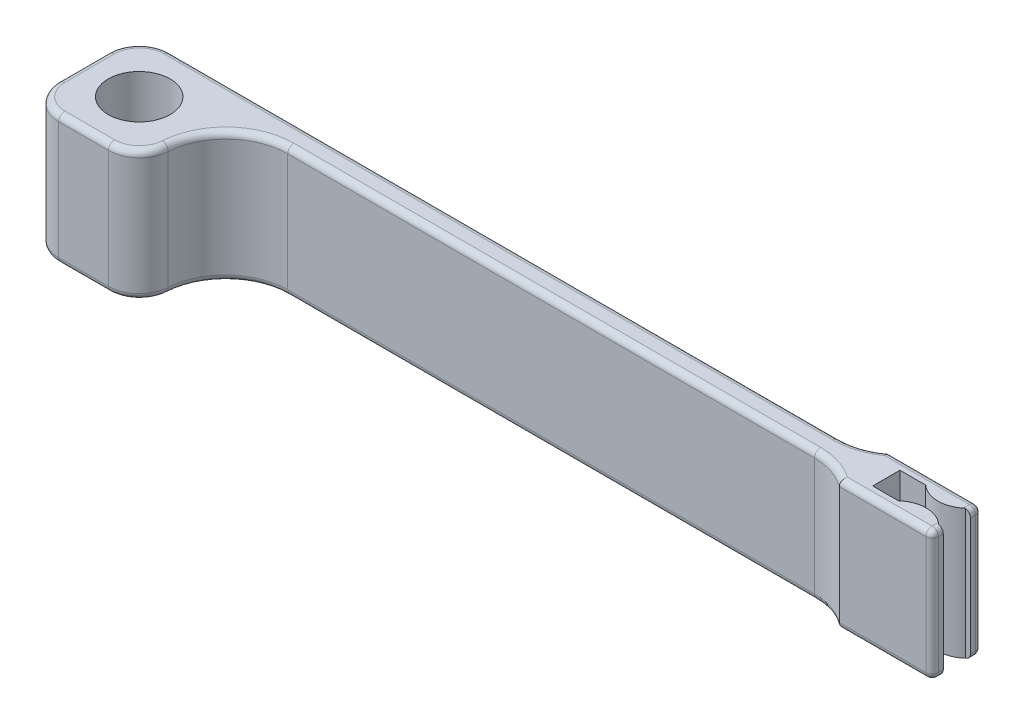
ISO-10303-21;
HEADER;
FILE_DESCRIPTION(('STEP AP214'),'2;1');
FILE_NAME('part.step','',(''),(''),'','','');
FILE_SCHEMA(('AUTOMOTIVE_DESIGN { 1 0 10303 214 1 1 1 1 }'));
ENDSEC;
DATA;
#1=APPLICATION_CONTEXT('core data for automotive mechanical design processes');
#2=APPLICATION_PROTOCOL_DEFINITION('international standard','automotive_design',2000,#1);
#3=PRODUCT_CONTEXT('',#1,'mechanical');
#4=PRODUCT('Part','Part','',(#3));
#5=PRODUCT_RELATED_PRODUCT_CATEGORY('part','',(#4));
#6=PRODUCT_DEFINITION_FORMATION('','',#4);
#7=PRODUCT_DEFINITION_CONTEXT('part definition',#1,'design');
#8=PRODUCT_DEFINITION('design','',#6,#7);
#9=PRODUCT_DEFINITION_SHAPE('','',#8);
#10=(LENGTH_UNIT() NAMED_UNIT(*) SI_UNIT(.MILLI.,.METRE.));
#11=(NAMED_UNIT(*) PLANE_ANGLE_UNIT() SI_UNIT($,.RADIAN.));
#12=(NAMED_UNIT(*) SI_UNIT($,.STERADIAN.) SOLID_ANGLE_UNIT());
#13=UNCERTAINTY_MEASURE_WITH_UNIT(LENGTH_MEASURE(1.E-05),#10,'distance_accuracy_value','');
#14=(GEOMETRIC_REPRESENTATION_CONTEXT(3) GLOBAL_UNCERTAINTY_ASSIGNED_CONTEXT((#13)) GLOBAL_UNIT_ASSIGNED_CONTEXT((#10,
#11,#12)) REPRESENTATION_CONTEXT('',''));
#15=CARTESIAN_POINT('',(0.,0.,0.));
#16=DIRECTION('',(0.,0.,1.));
#17=DIRECTION('',(1.,0.,0.));
#18=AXIS2_PLACEMENT_3D('',#15,#16,#17);
#19=CARTESIAN_POINT('',(-150.,10.5,4.));
#20=DIRECTION('',(0.,-1.,0.));
#21=DIRECTION('',(0.,0.,-1.));
#22=AXIS2_PLACEMENT_3D('',#19,#20,#21);
#23=PLANE('',#22);
#24=DIRECTION('',(-1.,0.,0.));
#25=VECTOR('',#24,1.);
#26=CARTESIAN_POINT('',(-44.8897995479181,10.5,4.2));
#27=LINE('',#26,#25);
#28=CARTESIAN_POINT('',(-41.1205115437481,10.5,4.2));
#29=VERTEX_POINT('',#28);
#30=CARTESIAN_POINT('',(-45.2897995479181,10.5,4.2));
#31=VERTEX_POINT('',#30);
#32=EDGE_CURVE('E344',#29,#31,#27,.T.);
#33=ORIENTED_EDGE('',*,*,#32,.T.);
#34=DIRECTION('',(0.,0.,1.));
#35=VECTOR('',#34,1.);
#36=CARTESIAN_POINT('',(-45.2897995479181,10.5,4.2));
#37=LINE('',#36,#35);
#38=CARTESIAN_POINT('',(-45.2897995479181,10.5,-0.2));
#39=VERTEX_POINT('',#38);
#40=EDGE_CURVE('E306',#39,#31,#37,.T.);
#41=ORIENTED_EDGE('',*,*,#40,.F.);
#42=DIRECTION('',(1.,0.,0.));
#43=VECTOR('',#42,1.);
#44=CARTESIAN_POINT('',(-44.8897995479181,10.5,-0.2));
#45=LINE('',#44,#43);
#46=CARTESIAN_POINT('',(-41.1205115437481,10.5,-0.200000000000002));
#47=VERTEX_POINT('',#46);
#48=EDGE_CURVE('E322',#39,#47,#45,.T.);
#49=ORIENTED_EDGE('',*,*,#48,.T.);
#50=CARTESIAN_POINT('',(-37.8897995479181,10.5,-3.75));
#51=DIRECTION('',(0.,1.,0.));
#52=DIRECTION('',(0.,0.,1.));
#53=AXIS2_PLACEMENT_3D('',#50,#51,#52);
#54=CIRCLE('',#53,4.8);
#55=CARTESIAN_POINT('',(-34.8897995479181,10.5,-0.00300120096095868));
#56=VERTEX_POINT('',#55);
#57=EDGE_CURVE('E325',#47,#56,#54,.T.);
#58=ORIENTED_EDGE('',*,*,#57,.T.);
#59=DIRECTION('',(0.,0.,-1.));
#60=VECTOR('',#59,1.);
#61=CARTESIAN_POINT('',(-34.8897995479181,10.5,-1.));
#62=LINE('',#61,#60);
#63=CARTESIAN_POINT('',(-34.8897995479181,10.5,-1.));
#64=VERTEX_POINT('',#63);
#65=EDGE_CURVE('E674',#56,#64,#62,.T.);
#66=ORIENTED_EDGE('',*,*,#65,.T.);
#67=DIRECTION('',(-1.,0.,0.));
#68=VECTOR('',#67,1.);
#69=CARTESIAN_POINT('',(-48.8897995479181,10.5,-1.));
#70=LINE('',#69,#68);
#71=CARTESIAN_POINT('',(-48.5652442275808,10.5,-1.00000000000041));
#72=VERTEX_POINT('',#71);
#73=EDGE_CURVE('E667',#64,#72,#70,.T.);
#74=ORIENTED_EDGE('',*,*,#73,.T.);
#75=CARTESIAN_POINT('',(-54.8897995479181,10.5,-10.));
#76=DIRECTION('',(0.,-1.,0.));
#77=DIRECTION('',(0.,0.,-1.));
#78=AXIS2_PLACEMENT_3D('',#75,#76,#77);
#79=CIRCLE('',#78,11.);
#80=CARTESIAN_POINT('',(-54.8897995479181,10.5,1.));
#81=VERTEX_POINT('',#80);
#82=EDGE_CURVE('E823',#72,#81,#79,.T.);
#83=ORIENTED_EDGE('',*,*,#82,.T.);
#84=DIRECTION('',(-1.,0.,0.));
#85=VECTOR('',#84,1.);
#86=CARTESIAN_POINT('',(-150.,10.5,1.));
#87=LINE('',#86,#85);
#88=CARTESIAN_POINT('',(-163.,10.5,1.));
#89=VERTEX_POINT('',#88);
#90=EDGE_CURVE('E826',#81,#89,#87,.T.);
#91=ORIENTED_EDGE('',*,*,#90,.T.);
#92=CARTESIAN_POINT('',(-163.,10.5,5.));
#93=DIRECTION('',(0.,-1.,0.));
#94=DIRECTION('',(0.,0.,-1.));
#95=AXIS2_PLACEMENT_3D('',#92,#93,#94);
#96=CIRCLE('',#95,4.);
#97=CARTESIAN_POINT('',(-167.,10.5,5.));
#98=VERTEX_POINT('',#97);
#99=EDGE_CURVE('E829',#89,#98,#96,.F.);
#100=ORIENTED_EDGE('',*,*,#99,.T.);
#101=DIRECTION('',(0.,0.,-1.));
#102=VECTOR('',#101,1.);
#103=CARTESIAN_POINT('',(-167.,10.5,4.));
#104=LINE('',#103,#102);
#105=CARTESIAN_POINT('',(-167.,10.5,13.));
#106=VERTEX_POINT('',#105);
#107=EDGE_CURVE('E895',#98,#106,#104,.F.);
#108=ORIENTED_EDGE('',*,*,#107,.T.);
#109=CARTESIAN_POINT('',(-163.,10.5,13.));
#110=DIRECTION('',(0.,-1.,0.));
#111=DIRECTION('',(0.,0.,-1.));
#112=AXIS2_PLACEMENT_3D('',#109,#110,#111);
#113=CIRCLE('',#112,4.);
#114=CARTESIAN_POINT('',(-163.,10.5,17.));
#115=VERTEX_POINT('',#114);
#116=EDGE_CURVE('E883',#106,#115,#113,.F.);
#117=ORIENTED_EDGE('',*,*,#116,.T.);
#118=DIRECTION('',(-1.,0.,0.));
#119=VECTOR('',#118,1.);
#120=CARTESIAN_POINT('',(-150.,10.5,17.));
#121=LINE('',#120,#119);
#122=CARTESIAN_POINT('',(-154.966629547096,10.5,17.));
#123=VERTEX_POINT('',#122);
#124=EDGE_CURVE('E897',#115,#123,#121,.F.);
#125=ORIENTED_EDGE('',*,*,#124,.T.);
#126=CARTESIAN_POINT('',(-154.966629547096,10.5,13.));
#127=DIRECTION('',(0.,-1.,0.));
#128=DIRECTION('',(0.,0.,-1.));
#129=AXIS2_PLACEMENT_3D('',#126,#127,#128);
#130=CIRCLE('',#129,4.);
#131=CARTESIAN_POINT('',(-150.975528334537,10.5,13.2666666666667));
#132=VERTEX_POINT('',#131);
#133=EDGE_CURVE('E901',#123,#132,#130,.F.);
#134=ORIENTED_EDGE('',*,*,#133,.T.);
#135=CARTESIAN_POINT('',(-140.,10.5,14.));
#136=DIRECTION('',(0.,-1.,0.));
#137=DIRECTION('',(0.,0.,-1.));
#138=AXIS2_PLACEMENT_3D('',#135,#136,#137);
#139=CIRCLE('',#138,11.);
#140=CARTESIAN_POINT('',(-140.,10.5,3.));
#141=VERTEX_POINT('',#140);
#142=EDGE_CURVE('E903',#132,#141,#139,.T.);
#143=ORIENTED_EDGE('',*,*,#142,.T.);
#144=DIRECTION('',(-1.,0.,0.));
#145=VECTOR('',#144,1.);
#146=CARTESIAN_POINT('',(-54.8897995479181,10.5,3.));
#147=LINE('',#146,#145);
#148=CARTESIAN_POINT('',(-54.8897995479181,10.5,3.));
#149=VERTEX_POINT('',#148);
#150=EDGE_CURVE('E905',#141,#149,#147,.F.);
#151=ORIENTED_EDGE('',*,*,#150,.T.);
#152=CARTESIAN_POINT('',(-54.8897995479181,10.5,14.));
#153=DIRECTION('',(0.,-1.,0.));
#154=DIRECTION('',(0.,0.,-1.));
#155=AXIS2_PLACEMENT_3D('',#152,#153,#154);
#156=CIRCLE('',#155,11.);
#157=CARTESIAN_POINT('',(-48.5652442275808,10.5,5.00000000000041));
#158=VERTEX_POINT('',#157);
#159=EDGE_CURVE('E825',#149,#158,#156,.T.);
#160=ORIENTED_EDGE('',*,*,#159,.T.);
#161=DIRECTION('',(1.,0.,0.));
#162=VECTOR('',#161,1.);
#163=CARTESIAN_POINT('',(-34.8897995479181,10.5,5.));
#164=LINE('',#163,#162);
#165=CARTESIAN_POINT('',(-34.8897995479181,10.5,5.));
#166=VERTEX_POINT('',#165);
#167=EDGE_CURVE('E672',#158,#166,#164,.T.);
#168=ORIENTED_EDGE('',*,*,#167,.T.);
#169=DIRECTION('',(0.,0.,-1.));
#170=VECTOR('',#169,1.);
#171=CARTESIAN_POINT('',(-34.8897995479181,10.5,4.2));
#172=LINE('',#171,#170);
#173=CARTESIAN_POINT('',(-34.8897995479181,10.5,4.00300120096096));
#174=VERTEX_POINT('',#173);
#175=EDGE_CURVE('E671',#166,#174,#172,.T.);
#176=ORIENTED_EDGE('',*,*,#175,.T.);
#177=CARTESIAN_POINT('',(-37.8897995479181,10.5,7.75));
#178=DIRECTION('',(0.,1.,0.));
#179=DIRECTION('',(0.,0.,-1.));
#180=AXIS2_PLACEMENT_3D('',#177,#178,#179);
#181=CIRCLE('',#180,4.8);
#182=EDGE_CURVE('E340',#174,#29,#181,.T.);
#183=ORIENTED_EDGE('',*,*,#182,.T.);
#184=EDGE_LOOP('',(#33,#41,#49,#58,#66,#74,#83,#91,#100,#108,#117,#125,#134,#143,#151,#160,#168,
#176,#183));
#185=FACE_BOUND('',#184,.T.);
#186=CARTESIAN_POINT('',(-159.,10.5,9.));
#187=DIRECTION('',(0.,1.,0.));
#188=DIRECTION('',(0.,0.,1.));
#189=AXIS2_PLACEMENT_3D('',#186,#187,#188);
#190=CIRCLE('',#189,5.);
#191=CARTESIAN_POINT('',(-159.,10.5,14.));
#192=VERTEX_POINT('',#191);
#193=EDGE_CURVE('E297',#192,#192,#190,.T.);
#194=ORIENTED_EDGE('',*,*,#193,.F.);
#195=EDGE_LOOP('',(#194));
#196=FACE_BOUND('',#195,.T.);
#197=ADVANCED_FACE('F37',(#185,#196),#23,.F.);
#198=CARTESIAN_POINT('',(-150.,-10.5,4.));
#199=DIRECTION('',(0.,1.,0.));
#200=DIRECTION('',(-1.,0.,0.));
#201=AXIS2_PLACEMENT_3D('',#198,#199,#200);
#202=PLANE('',#201);
#203=DIRECTION('',(0.,0.,-1.));
#204=VECTOR('',#203,1.);
#205=CARTESIAN_POINT('',(-45.2897995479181,-10.5,4.2));
#206=LINE('',#205,#204);
#207=CARTESIAN_POINT('',(-45.2897995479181,-10.5,4.2));
#208=VERTEX_POINT('',#207);
#209=CARTESIAN_POINT('',(-45.2897995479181,-10.5,-0.2));
#210=VERTEX_POINT('',#209);
#211=EDGE_CURVE('E304',#208,#210,#206,.T.);
#212=ORIENTED_EDGE('',*,*,#211,.F.);
#213=DIRECTION('',(1.,0.,0.));
#214=VECTOR('',#213,1.);
#215=CARTESIAN_POINT('',(-44.8897995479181,-10.5,4.2));
#216=LINE('',#215,#214);
#217=CARTESIAN_POINT('',(-41.1205115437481,-10.5,4.2));
#218=VERTEX_POINT('',#217);
#219=EDGE_CURVE('E285',#208,#218,#216,.T.);
#220=ORIENTED_EDGE('',*,*,#219,.T.);
#221=CARTESIAN_POINT('',(-37.8897995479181,-10.5,7.75));
#222=DIRECTION('',(0.,1.,0.));
#223=DIRECTION('',(-1.,0.,0.));
#224=AXIS2_PLACEMENT_3D('',#221,#222,#223);
#225=CIRCLE('',#224,4.8);
#226=CARTESIAN_POINT('',(-34.8897995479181,-10.5,4.00300120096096));
#227=VERTEX_POINT('',#226);
#228=EDGE_CURVE('E298',#218,#227,#225,.F.);
#229=ORIENTED_EDGE('',*,*,#228,.T.);
#230=DIRECTION('',(0.,0.,1.));
#231=VECTOR('',#230,1.);
#232=CARTESIAN_POINT('',(-34.8897995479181,-10.5,5.));
#233=LINE('',#232,#231);
#234=CARTESIAN_POINT('',(-34.8897995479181,-10.5,5.));
#235=VERTEX_POINT('',#234);
#236=EDGE_CURVE('E420',#227,#235,#233,.T.);
#237=ORIENTED_EDGE('',*,*,#236,.T.);
#238=DIRECTION('',(-1.,0.,0.));
#239=VECTOR('',#238,1.);
#240=CARTESIAN_POINT('',(-48.8897995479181,-10.5,5.));
#241=LINE('',#240,#239);
#242=CARTESIAN_POINT('',(-48.5652442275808,-10.5,5.00000000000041));
#243=VERTEX_POINT('',#242);
#244=EDGE_CURVE('E416',#235,#243,#241,.T.);
#245=ORIENTED_EDGE('',*,*,#244,.T.);
#246=CARTESIAN_POINT('',(-54.8897995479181,-10.5,14.));
#247=DIRECTION('',(0.,1.,0.));
#248=DIRECTION('',(-1.,0.,0.));
#249=AXIS2_PLACEMENT_3D('',#246,#247,#248);
#250=CIRCLE('',#249,11.);
#251=CARTESIAN_POINT('',(-54.8897995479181,-10.5,3.));
#252=VERTEX_POINT('',#251);
#253=EDGE_CURVE('E398',#243,#252,#250,.T.);
#254=ORIENTED_EDGE('',*,*,#253,.T.);
#255=DIRECTION('',(1.,0.,0.));
#256=VECTOR('',#255,1.);
#257=CARTESIAN_POINT('',(-140.,-10.5,3.));
#258=LINE('',#257,#256);
#259=CARTESIAN_POINT('',(-140.,-10.5,3.));
#260=VERTEX_POINT('',#259);
#261=EDGE_CURVE('E396',#252,#260,#258,.F.);
#262=ORIENTED_EDGE('',*,*,#261,.T.);
#263=CARTESIAN_POINT('',(-140.,-10.5,14.));
#264=DIRECTION('',(0.,1.,0.));
#265=DIRECTION('',(-1.,0.,0.));
#266=AXIS2_PLACEMENT_3D('',#263,#264,#265);
#267=CIRCLE('',#266,11.);
#268=CARTESIAN_POINT('',(-150.975528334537,-10.5,13.2666666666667));
#269=VERTEX_POINT('',#268);
#270=EDGE_CURVE('E400',#260,#269,#267,.T.);
#271=ORIENTED_EDGE('',*,*,#270,.T.);
#272=CARTESIAN_POINT('',(-154.966629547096,-10.5,13.));
#273=DIRECTION('',(0.,1.,0.));
#274=DIRECTION('',(-1.,0.,0.));
#275=AXIS2_PLACEMENT_3D('',#272,#273,#274);
#276=CIRCLE('',#275,4.);
#277=CARTESIAN_POINT('',(-154.966629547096,-10.5,17.));
#278=VERTEX_POINT('',#277);
#279=EDGE_CURVE('E402',#269,#278,#276,.F.);
#280=ORIENTED_EDGE('',*,*,#279,.T.);
#281=DIRECTION('',(1.,0.,0.));
#282=VECTOR('',#281,1.);
#283=CARTESIAN_POINT('',(-150.,-10.5,17.));
#284=LINE('',#283,#282);
#285=CARTESIAN_POINT('',(-163.,-10.5,17.));
#286=VERTEX_POINT('',#285);
#287=EDGE_CURVE('E404',#278,#286,#284,.F.);
#288=ORIENTED_EDGE('',*,*,#287,.T.);
#289=CARTESIAN_POINT('',(-163.,-10.5,13.));
#290=DIRECTION('',(0.,1.,0.));
#291=DIRECTION('',(-1.,0.,0.));
#292=AXIS2_PLACEMENT_3D('',#289,#290,#291);
#293=CIRCLE('',#292,4.);
#294=CARTESIAN_POINT('',(-167.,-10.5,13.));
#295=VERTEX_POINT('',#294);
#296=EDGE_CURVE('E406',#286,#295,#293,.F.);
#297=ORIENTED_EDGE('',*,*,#296,.T.);
#298=DIRECTION('',(0.,0.,1.));
#299=VECTOR('',#298,1.);
#300=CARTESIAN_POINT('',(-167.,-10.5,4.));
#301=LINE('',#300,#299);
#302=CARTESIAN_POINT('',(-167.,-10.5,5.));
#303=VERTEX_POINT('',#302);
#304=EDGE_CURVE('E408',#295,#303,#301,.F.);
#305=ORIENTED_EDGE('',*,*,#304,.T.);
#306=CARTESIAN_POINT('',(-163.,-10.5,5.));
#307=DIRECTION('',(0.,1.,0.));
#308=DIRECTION('',(-1.,0.,0.));
#309=AXIS2_PLACEMENT_3D('',#306,#307,#308);
#310=CIRCLE('',#309,4.);
#311=CARTESIAN_POINT('',(-163.,-10.5,1.));
#312=VERTEX_POINT('',#311);
#313=EDGE_CURVE('E410',#303,#312,#310,.F.);
#314=ORIENTED_EDGE('',*,*,#313,.T.);
#315=DIRECTION('',(1.,0.,0.));
#316=VECTOR('',#315,1.);
#317=CARTESIAN_POINT('',(-150.,-10.5,1.));
#318=LINE('',#317,#316);
#319=CARTESIAN_POINT('',(-54.8897995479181,-10.5,1.));
#320=VERTEX_POINT('',#319);
#321=EDGE_CURVE('E412',#312,#320,#318,.T.);
#322=ORIENTED_EDGE('',*,*,#321,.T.);
#323=CARTESIAN_POINT('',(-54.8897995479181,-10.5,-10.));
#324=DIRECTION('',(0.,1.,0.));
#325=DIRECTION('',(-1.,0.,0.));
#326=AXIS2_PLACEMENT_3D('',#323,#324,#325);
#327=CIRCLE('',#326,11.);
#328=CARTESIAN_POINT('',(-48.5652442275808,-10.5,-1.00000000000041));
#329=VERTEX_POINT('',#328);
#330=EDGE_CURVE('E414',#320,#329,#327,.T.);
#331=ORIENTED_EDGE('',*,*,#330,.T.);
#332=DIRECTION('',(1.,0.,0.));
#333=VECTOR('',#332,1.);
#334=CARTESIAN_POINT('',(-34.8897995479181,-10.5,-1.));
#335=LINE('',#334,#333);
#336=CARTESIAN_POINT('',(-34.8897995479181,-10.5,-1.));
#337=VERTEX_POINT('',#336);
#338=EDGE_CURVE('E418',#329,#337,#335,.T.);
#339=ORIENTED_EDGE('',*,*,#338,.T.);
#340=DIRECTION('',(0.,0.,1.));
#341=VECTOR('',#340,1.);
#342=CARTESIAN_POINT('',(-34.8897995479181,-10.5,-0.200000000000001));
#343=LINE('',#342,#341);
#344=CARTESIAN_POINT('',(-34.8897995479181,-10.5,-0.00300120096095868));
#345=VERTEX_POINT('',#344);
#346=EDGE_CURVE('E422',#337,#345,#343,.T.);
#347=ORIENTED_EDGE('',*,*,#346,.T.);
#348=CARTESIAN_POINT('',(-37.8897995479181,-10.5,-3.75));
#349=DIRECTION('',(0.,1.,0.));
#350=DIRECTION('',(-1.,0.,0.));
#351=AXIS2_PLACEMENT_3D('',#348,#349,#350);
#352=CIRCLE('',#351,4.8);
#353=CARTESIAN_POINT('',(-41.1205115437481,-10.5,-0.200000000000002));
#354=VERTEX_POINT('',#353);
#355=EDGE_CURVE('E319',#345,#354,#352,.F.);
#356=ORIENTED_EDGE('',*,*,#355,.T.);
#357=DIRECTION('',(-1.,0.,0.));
#358=VECTOR('',#357,1.);
#359=CARTESIAN_POINT('',(-44.8897995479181,-10.5,-0.2));
#360=LINE('',#359,#358);
#361=EDGE_CURVE('E311',#354,#210,#360,.T.);
#362=ORIENTED_EDGE('',*,*,#361,.T.);
#363=EDGE_LOOP('',(#212,#220,#229,#237,#245,#254,#262,#271,#280,#288,#297,#305,#314,#322,#331,
#339,#347,#356,#362));
#364=FACE_BOUND('',#363,.T.);
#365=CARTESIAN_POINT('',(-159.,-10.5,9.));
#366=DIRECTION('',(0.,1.,0.));
#367=DIRECTION('',(-1.,0.,0.));
#368=AXIS2_PLACEMENT_3D('',#365,#366,#367);
#369=CIRCLE('',#368,5.);
#370=CARTESIAN_POINT('',(-164.,-10.5,9.));
#371=VERTEX_POINT('',#370);
#372=EDGE_CURVE('E354',#371,#371,#369,.F.);
#373=ORIENTED_EDGE('',*,*,#372,.F.);
#374=EDGE_LOOP('',(#373));
#375=FACE_BOUND('',#374,.T.);
#376=ADVANCED_FACE('F308',(#364,#375),#202,.F.);
#377=CARTESIAN_POINT('',(0.,0.,4.));
#378=DIRECTION('',(0.,0.,1.));
#379=DIRECTION('',(1.,0.,0.));
#380=AXIS2_PLACEMENT_3D('',#377,#378,#379);
#381=PLANE('',#380);
#382=DIRECTION('',(0.,-1.,0.));
#383=VECTOR('',#382,1.);
#384=CARTESIAN_POINT('',(-140.,0.,4.));
#385=LINE('',#384,#383);
#386=CARTESIAN_POINT('',(-140.,9.5,4.));
#387=VERTEX_POINT('',#386);
#388=CARTESIAN_POINT('',(-140.,-9.5,4.));
#389=VERTEX_POINT('',#388);
#390=EDGE_CURVE('E357',#387,#389,#385,.T.);
#391=ORIENTED_EDGE('',*,*,#390,.T.);
#392=DIRECTION('',(1.,0.,0.));
#393=VECTOR('',#392,1.);
#394=CARTESIAN_POINT('',(-54.8897995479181,-9.5,4.));
#395=LINE('',#394,#393);
#396=CARTESIAN_POINT('',(-54.8897995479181,-9.5,4.));
#397=VERTEX_POINT('',#396);
#398=EDGE_CURVE('E11',#389,#397,#395,.T.);
#399=ORIENTED_EDGE('',*,*,#398,.T.);
#400=DIRECTION('',(0.,-1.,0.));
#401=VECTOR('',#400,1.);
#402=CARTESIAN_POINT('',(-54.8897995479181,10.5,4.));
#403=LINE('',#402,#401);
#404=CARTESIAN_POINT('',(-54.8897995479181,9.5,4.));
#405=VERTEX_POINT('',#404);
#406=EDGE_CURVE('E379',#397,#405,#403,.F.);
#407=ORIENTED_EDGE('',*,*,#406,.T.);
#408=DIRECTION('',(-1.,0.,0.));
#409=VECTOR('',#408,1.);
#410=CARTESIAN_POINT('',(-140.,9.5,4.));
#411=LINE('',#410,#409);
#412=EDGE_CURVE('E47',#405,#387,#411,.T.);
#413=ORIENTED_EDGE('',*,*,#412,.T.);
#414=EDGE_LOOP('',(#391,#399,#407,#413));
#415=FACE_BOUND('',#414,.T.);
#416=ADVANCED_FACE('F530',(#415),#381,.T.);
#417=CARTESIAN_POINT('',(0.,0.,0.));
#418=DIRECTION('',(0.,0.,1.));
#419=DIRECTION('',(1.,0.,0.));
#420=AXIS2_PLACEMENT_3D('',#417,#418,#419);
#421=PLANE('',#420);
#422=DIRECTION('',(0.,-1.,0.));
#423=VECTOR('',#422,1.);
#424=CARTESIAN_POINT('',(-54.8897995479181,0.,0.));
#425=LINE('',#424,#423);
#426=CARTESIAN_POINT('',(-54.8897995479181,9.5,0.));
#427=VERTEX_POINT('',#426);
#428=CARTESIAN_POINT('',(-54.8897995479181,-9.5,0.));
#429=VERTEX_POINT('',#428);
#430=EDGE_CURVE('E381',#427,#429,#425,.T.);
#431=ORIENTED_EDGE('',*,*,#430,.T.);
#432=DIRECTION('',(1.,0.,0.));
#433=VECTOR('',#432,1.);
#434=CARTESIAN_POINT('',(0.,-9.5,0.));
#435=LINE('',#434,#433);
#436=CARTESIAN_POINT('',(-163.,-9.5,0.));
#437=VERTEX_POINT('',#436);
#438=EDGE_CURVE('E737',#429,#437,#435,.F.);
#439=ORIENTED_EDGE('',*,*,#438,.T.);
#440=DIRECTION('',(0.,1.,0.));
#441=VECTOR('',#440,1.);
#442=CARTESIAN_POINT('',(-163.,0.,0.));
#443=LINE('',#442,#441);
#444=CARTESIAN_POINT('',(-163.,9.5,0.));
#445=VERTEX_POINT('',#444);
#446=EDGE_CURVE('E376',#437,#445,#443,.T.);
#447=ORIENTED_EDGE('',*,*,#446,.T.);
#448=DIRECTION('',(-1.,0.,0.));
#449=VECTOR('',#448,1.);
#450=CARTESIAN_POINT('',(0.,9.5,0.));
#451=LINE('',#450,#449);
#452=EDGE_CURVE('E740',#445,#427,#451,.F.);
#453=ORIENTED_EDGE('',*,*,#452,.T.);
#454=EDGE_LOOP('',(#431,#439,#447,#453));
#455=FACE_BOUND('',#454,.T.);
#456=ADVANCED_FACE('F728',(#455),#421,.F.);
#457=CARTESIAN_POINT('',(-159.,-35.9558441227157,9.));
#458=DIRECTION('',(0.,1.,0.));
#459=DIRECTION('',(0.,0.,1.));
#460=AXIS2_PLACEMENT_3D('',#457,#458,#459);
#461=CYLINDRICAL_SURFACE('',#460,5.);
#462=ORIENTED_EDGE('',*,*,#372,.T.);
#463=EDGE_LOOP('',(#462));
#464=FACE_BOUND('',#463,.T.);
#465=ORIENTED_EDGE('',*,*,#193,.T.);
#466=EDGE_LOOP('',(#465));
#467=FACE_BOUND('',#466,.T.);
#468=ADVANCED_FACE('F724',(#464,#467),#461,.F.);
#469=CARTESIAN_POINT('',(-168.,-35.9558441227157,0.));
#470=DIRECTION('',(1.,0.,0.));
#471=DIRECTION('',(0.,0.,-1.));
#472=AXIS2_PLACEMENT_3D('',#469,#470,#471);
#473=PLANE('',#472);
#474=DIRECTION('',(0.,1.,0.));
#475=VECTOR('',#474,1.);
#476=CARTESIAN_POINT('',(-168.,-35.9558441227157,5.));
#477=LINE('',#476,#475);
#478=CARTESIAN_POINT('',(-168.,9.49999999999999,5.));
#479=VERTEX_POINT('',#478);
#480=CARTESIAN_POINT('',(-168.,-9.5,5.));
#481=VERTEX_POINT('',#480);
#482=EDGE_CURVE('E370',#479,#481,#477,.F.);
#483=ORIENTED_EDGE('',*,*,#482,.T.);
#484=DIRECTION('',(0.,0.,1.));
#485=VECTOR('',#484,1.);
#486=CARTESIAN_POINT('',(-168.,-9.5,0.));
#487=LINE('',#486,#485);
#488=CARTESIAN_POINT('',(-168.,-9.5,13.));
#489=VERTEX_POINT('',#488);
#490=EDGE_CURVE('E764',#481,#489,#487,.T.);
#491=ORIENTED_EDGE('',*,*,#490,.T.);
#492=DIRECTION('',(0.,1.,0.));
#493=VECTOR('',#492,1.);
#494=CARTESIAN_POINT('',(-168.,-35.9558441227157,13.));
#495=LINE('',#494,#493);
#496=CARTESIAN_POINT('',(-168.,9.49999999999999,13.));
#497=VERTEX_POINT('',#496);
#498=EDGE_CURVE('E373',#489,#497,#495,.T.);
#499=ORIENTED_EDGE('',*,*,#498,.T.);
#500=DIRECTION('',(0.,0.,-1.));
#501=VECTOR('',#500,1.);
#502=CARTESIAN_POINT('',(-168.,9.49999999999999,0.));
#503=LINE('',#502,#501);
#504=EDGE_CURVE('E762',#497,#479,#503,.T.);
#505=ORIENTED_EDGE('',*,*,#504,.T.);
#506=EDGE_LOOP('',(#483,#491,#499,#505));
#507=FACE_BOUND('',#506,.T.);
#508=ADVANCED_FACE('F720',(#507),#473,.F.);
#509=CARTESIAN_POINT('',(0.,-35.9558441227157,18.));
#510=DIRECTION('',(0.,0.,-1.));
#511=DIRECTION('',(-1.,0.,0.));
#512=AXIS2_PLACEMENT_3D('',#509,#510,#511);
#513=PLANE('',#512);
#514=DIRECTION('',(0.,1.,0.));
#515=VECTOR('',#514,1.);
#516=CARTESIAN_POINT('',(-163.,-35.9558441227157,18.));
#517=LINE('',#516,#515);
#518=CARTESIAN_POINT('',(-163.,9.49999999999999,18.));
#519=VERTEX_POINT('',#518);
#520=CARTESIAN_POINT('',(-163.,-9.5,18.));
#521=VERTEX_POINT('',#520);
#522=EDGE_CURVE('E361',#519,#521,#517,.F.);
#523=ORIENTED_EDGE('',*,*,#522,.T.);
#524=DIRECTION('',(1.,0.,0.));
#525=VECTOR('',#524,1.);
#526=CARTESIAN_POINT('',(0.,-9.5,18.));
#527=LINE('',#526,#525);
#528=CARTESIAN_POINT('',(-154.966629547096,-9.5,18.));
#529=VERTEX_POINT('',#528);
#530=EDGE_CURVE('E775',#521,#529,#527,.T.);
#531=ORIENTED_EDGE('',*,*,#530,.T.);
#532=DIRECTION('',(0.,-1.,0.));
#533=VECTOR('',#532,1.);
#534=CARTESIAN_POINT('',(-154.966629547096,-35.9558441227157,18.));
#535=LINE('',#534,#533);
#536=CARTESIAN_POINT('',(-154.966629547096,9.49999999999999,18.));
#537=VERTEX_POINT('',#536);
#538=EDGE_CURVE('E364',#529,#537,#535,.F.);
#539=ORIENTED_EDGE('',*,*,#538,.T.);
#540=DIRECTION('',(-1.,0.,0.));
#541=VECTOR('',#540,1.);
#542=CARTESIAN_POINT('',(0.,9.49999999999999,18.));
#543=LINE('',#542,#541);
#544=EDGE_CURVE('E773',#537,#519,#543,.T.);
#545=ORIENTED_EDGE('',*,*,#544,.T.);
#546=EDGE_LOOP('',(#523,#531,#539,#545));
#547=FACE_BOUND('',#546,.T.);
#548=ADVANCED_FACE('F539',(#547),#513,.F.);
#549=CARTESIAN_POINT('',(-140.,0.,14.));
#550=DIRECTION('',(0.,-1.,0.));
#551=DIRECTION('',(0.,0.,-1.));
#552=AXIS2_PLACEMENT_3D('',#549,#550,#551);
#553=CYLINDRICAL_SURFACE('',#552,10.);
#554=DIRECTION('',(0.,-1.,0.));
#555=VECTOR('',#554,1.);
#556=CARTESIAN_POINT('',(-149.977753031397,0.,13.3333333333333));
#557=LINE('',#556,#555);
#558=CARTESIAN_POINT('',(-149.977753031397,9.5,13.3333333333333));
#559=VERTEX_POINT('',#558);
#560=CARTESIAN_POINT('',(-149.977753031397,-9.5,13.3333333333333));
#561=VERTEX_POINT('',#560);
#562=EDGE_CURVE('E367',#559,#561,#557,.T.);
#563=ORIENTED_EDGE('',*,*,#562,.T.);
#564=CARTESIAN_POINT('',(-140.,-9.5,14.));
#565=DIRECTION('',(0.,1.,0.));
#566=DIRECTION('',(-1.,0.,0.));
#567=AXIS2_PLACEMENT_3D('',#564,#565,#566);
#568=CIRCLE('',#567,10.);
#569=EDGE_CURVE('E783',#561,#389,#568,.F.);
#570=ORIENTED_EDGE('',*,*,#569,.T.);
#571=ORIENTED_EDGE('',*,*,#390,.F.);
#572=CARTESIAN_POINT('',(-140.,9.5,14.));
#573=DIRECTION('',(0.,-1.,0.));
#574=DIRECTION('',(0.,0.,-1.));
#575=AXIS2_PLACEMENT_3D('',#572,#573,#574);
#576=CIRCLE('',#575,10.);
#577=EDGE_CURVE('E781',#387,#559,#576,.F.);
#578=ORIENTED_EDGE('',*,*,#577,.T.);
#579=EDGE_LOOP('',(#563,#570,#571,#578));
#580=FACE_BOUND('',#579,.T.);
#581=ADVANCED_FACE('F535',(#580),#553,.F.);
#582=CARTESIAN_POINT('',(-154.966629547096,0.,13.));
#583=DIRECTION('',(0.,-1.,0.));
#584=DIRECTION('',(0.,0.,-1.));
#585=AXIS2_PLACEMENT_3D('',#582,#583,#584);
#586=CYLINDRICAL_SURFACE('',#585,5.);
#587=ORIENTED_EDGE('',*,*,#538,.F.);
#588=CARTESIAN_POINT('',(-154.966629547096,-9.5,13.));
#589=DIRECTION('',(0.,1.,0.));
#590=DIRECTION('',(-1.,0.,0.));
#591=AXIS2_PLACEMENT_3D('',#588,#589,#590);
#592=CIRCLE('',#591,5.);
#593=EDGE_CURVE('E779',#529,#561,#592,.T.);
#594=ORIENTED_EDGE('',*,*,#593,.T.);
#595=ORIENTED_EDGE('',*,*,#562,.F.);
#596=CARTESIAN_POINT('',(-154.966629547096,9.5,13.));
#597=DIRECTION('',(0.,-1.,0.));
#598=DIRECTION('',(0.,0.,-1.));
#599=AXIS2_PLACEMENT_3D('',#596,#597,#598);
#600=CIRCLE('',#599,5.);
#601=EDGE_CURVE('E777',#559,#537,#600,.T.);
#602=ORIENTED_EDGE('',*,*,#601,.T.);
#603=EDGE_LOOP('',(#587,#594,#595,#602));
#604=FACE_BOUND('',#603,.T.);
#605=ADVANCED_FACE('F538',(#604),#586,.T.);
#606=CARTESIAN_POINT('',(-163.,-35.9558441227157,13.));
#607=DIRECTION('',(0.,1.,0.));
#608=DIRECTION('',(0.,0.,1.));
#609=AXIS2_PLACEMENT_3D('',#606,#607,#608);
#610=CYLINDRICAL_SURFACE('',#609,5.);
#611=ORIENTED_EDGE('',*,*,#498,.F.);
#612=CARTESIAN_POINT('',(-163.,-9.5,13.));
#613=DIRECTION('',(0.,1.,0.));
#614=DIRECTION('',(-1.,0.,0.));
#615=AXIS2_PLACEMENT_3D('',#612,#613,#614);
#616=CIRCLE('',#615,5.);
#617=EDGE_CURVE('E771',#489,#521,#616,.T.);
#618=ORIENTED_EDGE('',*,*,#617,.T.);
#619=ORIENTED_EDGE('',*,*,#522,.F.);
#620=CARTESIAN_POINT('',(-163.,9.49999999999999,13.));
#621=DIRECTION('',(0.,-1.,0.));
#622=DIRECTION('',(0.,0.,-1.));
#623=AXIS2_PLACEMENT_3D('',#620,#621,#622);
#624=CIRCLE('',#623,5.);
#625=EDGE_CURVE('E769',#519,#497,#624,.T.);
#626=ORIENTED_EDGE('',*,*,#625,.T.);
#627=EDGE_LOOP('',(#611,#618,#619,#626));
#628=FACE_BOUND('',#627,.T.);
#629=ADVANCED_FACE('F543',(#628),#610,.T.);
#630=CARTESIAN_POINT('',(-163.,0.,5.));
#631=DIRECTION('',(0.,1.,0.));
#632=DIRECTION('',(0.,0.,1.));
#633=AXIS2_PLACEMENT_3D('',#630,#631,#632);
#634=CYLINDRICAL_SURFACE('',#633,5.);
#635=ORIENTED_EDGE('',*,*,#446,.F.);
#636=CARTESIAN_POINT('',(-163.,-9.5,5.));
#637=DIRECTION('',(0.,1.,0.));
#638=DIRECTION('',(-1.,0.,0.));
#639=AXIS2_PLACEMENT_3D('',#636,#637,#638);
#640=CIRCLE('',#639,5.);
#641=EDGE_CURVE('E760',#437,#481,#640,.T.);
#642=ORIENTED_EDGE('',*,*,#641,.T.);
#643=ORIENTED_EDGE('',*,*,#482,.F.);
#644=CARTESIAN_POINT('',(-163.,9.5,5.));
#645=DIRECTION('',(0.,-1.,0.));
#646=DIRECTION('',(0.,0.,-1.));
#647=AXIS2_PLACEMENT_3D('',#644,#645,#646);
#648=CIRCLE('',#647,5.);
#649=EDGE_CURVE('E747',#479,#445,#648,.T.);
#650=ORIENTED_EDGE('',*,*,#649,.T.);
#651=EDGE_LOOP('',(#635,#642,#643,#650));
#652=FACE_BOUND('',#651,.T.);
#653=ADVANCED_FACE('F547',(#652),#634,.T.);
#654=CARTESIAN_POINT('',(-48.8897995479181,-25.8069428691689,6.));
#655=DIRECTION('',(0.,0.,1.));
#656=DIRECTION('',(1.,0.,0.));
#657=AXIS2_PLACEMENT_3D('',#654,#655,#656);
#658=PLANE('',#657);
#659=DIRECTION('',(0.,1.,0.));
#660=VECTOR('',#659,1.);
#661=CARTESIAN_POINT('',(-48.8897995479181,-25.8069428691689,6.));
#662=LINE('',#661,#660);
#663=CARTESIAN_POINT('',(-48.8897995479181,-9.5,6.));
#664=VERTEX_POINT('',#663);
#665=CARTESIAN_POINT('',(-48.8897995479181,9.5,6.));
#666=VERTEX_POINT('',#665);
#667=EDGE_CURVE('E341',#664,#666,#662,.T.);
#668=ORIENTED_EDGE('',*,*,#667,.F.);
#669=DIRECTION('',(-1.,0.,0.));
#670=VECTOR('',#669,1.);
#671=CARTESIAN_POINT('',(-34.8897995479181,-9.5,6.));
#672=LINE('',#671,#670);
#673=CARTESIAN_POINT('',(-34.8897995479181,-9.5,6.));
#674=VERTEX_POINT('',#673);
#675=EDGE_CURVE('E794',#664,#674,#672,.F.);
#676=ORIENTED_EDGE('',*,*,#675,.T.);
#677=DIRECTION('',(0.,1.,0.));
#678=VECTOR('',#677,1.);
#679=CARTESIAN_POINT('',(-34.8897995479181,-25.8069428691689,6.));
#680=LINE('',#679,#678);
#681=CARTESIAN_POINT('',(-34.8897995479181,9.5,6.));
#682=VERTEX_POINT('',#681);
#683=EDGE_CURVE('E384',#674,#682,#680,.T.);
#684=ORIENTED_EDGE('',*,*,#683,.T.);
#685=DIRECTION('',(1.,0.,0.));
#686=VECTOR('',#685,1.);
#687=CARTESIAN_POINT('',(-48.8897995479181,9.5,6.));
#688=LINE('',#687,#686);
#689=EDGE_CURVE('E792',#682,#666,#688,.F.);
#690=ORIENTED_EDGE('',*,*,#689,.T.);
#691=EDGE_LOOP('',(#668,#676,#684,#690));
#692=FACE_BOUND('',#691,.T.);
#693=ADVANCED_FACE('F551',(#692),#658,.T.);
#694=CARTESIAN_POINT('',(-44.8897995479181,-25.8069428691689,4.2));
#695=DIRECTION('',(0.,0.,-1.));
#696=DIRECTION('',(-1.,0.,0.));
#697=AXIS2_PLACEMENT_3D('',#694,#695,#696);
#698=PLANE('',#697);
#699=ORIENTED_EDGE('',*,*,#219,.F.);
#700=DIRECTION('',(0.,-1.,0.));
#701=VECTOR('',#700,1.);
#702=CARTESIAN_POINT('',(-45.2897995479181,-10.5,4.2));
#703=LINE('',#702,#701);
#704=EDGE_CURVE('E289',#31,#208,#703,.T.);
#705=ORIENTED_EDGE('',*,*,#704,.F.);
#706=ORIENTED_EDGE('',*,*,#32,.F.);
#707=DIRECTION('',(0.,1.,0.));
#708=VECTOR('',#707,1.);
#709=CARTESIAN_POINT('',(-41.1205115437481,-25.8069428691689,4.2));
#710=LINE('',#709,#708);
#711=EDGE_CURVE('E292',#218,#29,#710,.T.);
#712=ORIENTED_EDGE('',*,*,#711,.F.);
#713=EDGE_LOOP('',(#699,#705,#706,#712));
#714=FACE_BOUND('',#713,.T.);
#715=ADVANCED_FACE('F287',(#714),#698,.T.);
#716=CARTESIAN_POINT('',(-37.8897995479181,-25.8069428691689,7.75));
#717=DIRECTION('',(0.,1.,0.));
#718=DIRECTION('',(0.,0.,1.));
#719=AXIS2_PLACEMENT_3D('',#716,#717,#718);
#720=CYLINDRICAL_SURFACE('',#719,4.8);
#721=DIRECTION('',(0.,1.,0.));
#722=VECTOR('',#721,1.);
#723=CARTESIAN_POINT('',(-34.6590875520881,-25.8069428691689,4.2));
#724=LINE('',#723,#722);
#725=CARTESIAN_POINT('',(-34.6590875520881,-10.4730220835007,4.2));
#726=VERTEX_POINT('',#725);
#727=CARTESIAN_POINT('',(-34.6590875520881,10.4730220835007,4.2));
#728=VERTEX_POINT('',#727);
#729=EDGE_CURVE('E349',#726,#728,#724,.T.);
#730=ORIENTED_EDGE('',*,*,#729,.F.);
#731=CARTESIAN_POINT('',(-34.6590875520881,-10.4730220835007,4.2));
#732=CARTESIAN_POINT('',(-34.6776215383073,-10.4774161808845,4.18313238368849));
#733=CARTESIAN_POINT('',(-34.6963555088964,-10.4812992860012,4.16634930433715));
#734=CARTESIAN_POINT('',(-34.7341516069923,-10.4879987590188,4.13302356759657));
#735=CARTESIAN_POINT('',(-34.7532129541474,-10.4908173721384,4.11648047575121));
#736=CARTESIAN_POINT('',(-34.7916714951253,-10.4953621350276,4.08363368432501));
#737=CARTESIAN_POINT('',(-34.8110686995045,-10.4970882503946,4.06732999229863));
#738=CARTESIAN_POINT('',(-34.8502004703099,-10.4994081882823,4.03496503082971));
#739=CARTESIAN_POINT('',(-34.8699356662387,-10.4999995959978,4.01890435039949));
#740=CARTESIAN_POINT('',(-34.8897995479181,-10.5,4.00300120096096));
#741=B_SPLINE_CURVE_WITH_KNOTS('',3,(#731,#732,#733,#734,#735,#736,#737,#738,#739,#740),
.UNSPECIFIED.,.F.,.F.,(4,2,2,2,4),(0.,0.076324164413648,0.152486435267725,0.228651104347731,
0.30497768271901),.UNSPECIFIED.);
#742=EDGE_CURVE('E694',#726,#227,#741,.T.);
#743=ORIENTED_EDGE('',*,*,#742,.T.);
#744=ORIENTED_EDGE('',*,*,#228,.F.);
#745=ORIENTED_EDGE('',*,*,#711,.T.);
#746=ORIENTED_EDGE('',*,*,#182,.F.);
#747=CARTESIAN_POINT('',(-34.8897995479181,10.5,4.00300120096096));
#748=CARTESIAN_POINT('',(-34.8699356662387,10.4999995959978,4.0189043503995));
#749=CARTESIAN_POINT('',(-34.8502004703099,10.4994081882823,4.03496503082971));
#750=CARTESIAN_POINT('',(-34.8110686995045,10.4970882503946,4.06732999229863));
#751=CARTESIAN_POINT('',(-34.7916714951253,10.4953621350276,4.083633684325));
#752=CARTESIAN_POINT('',(-34.7532129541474,10.4908173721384,4.11648047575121));
#753=CARTESIAN_POINT('',(-34.7341516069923,10.4879987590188,4.13302356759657));
#754=CARTESIAN_POINT('',(-34.6963555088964,10.4812992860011,4.16634930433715));
#755=CARTESIAN_POINT('',(-34.6776215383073,10.4774161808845,4.18313238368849));
#756=CARTESIAN_POINT('',(-34.6590875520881,10.4730220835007,4.2));
#757=B_SPLINE_CURVE_WITH_KNOTS('',3,(#747,#748,#749,#750,#751,#752,#753,#754,#755,#756),
.UNSPECIFIED.,.F.,.F.,(4,2,2,2,4),(0.,0.0763265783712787,0.152491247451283,0.228653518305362,
0.304977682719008),.UNSPECIFIED.);
#758=EDGE_CURVE('E688',#174,#728,#757,.T.);
#759=ORIENTED_EDGE('',*,*,#758,.T.);
#760=EDGE_LOOP('',(#730,#743,#744,#745,#746,#759));
#761=FACE_BOUND('',#760,.T.);
#762=ADVANCED_FACE('F699',(#761),#720,.T.);
#763=CARTESIAN_POINT('',(-34.6590875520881,-25.8069428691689,4.2));
#764=DIRECTION('',(0.,0.,-1.));
#765=DIRECTION('',(-1.,0.,0.));
#766=AXIS2_PLACEMENT_3D('',#763,#764,#765);
#767=PLANE('',#766);
#768=DIRECTION('',(0.,1.,0.));
#769=VECTOR('',#768,1.);
#770=CARTESIAN_POINT('',(-33.8897995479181,-25.8069428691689,4.2));
#771=LINE('',#770,#769);
#772=CARTESIAN_POINT('',(-33.8897995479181,-9.5,4.2));
#773=VERTEX_POINT('',#772);
#774=CARTESIAN_POINT('',(-33.8897995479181,9.5,4.2));
#775=VERTEX_POINT('',#774);
#776=EDGE_CURVE('E346',#773,#775,#771,.T.);
#777=ORIENTED_EDGE('',*,*,#776,.F.);
#778=CARTESIAN_POINT('',(-34.8897995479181,-9.5,4.2));
#779=DIRECTION('',(0.,0.,-1.));
#780=DIRECTION('',(-1.,0.,0.));
#781=AXIS2_PLACEMENT_3D('',#778,#779,#780);
#782=CIRCLE('',#781,1.);
#783=EDGE_CURVE('E686',#773,#726,#782,.T.);
#784=ORIENTED_EDGE('',*,*,#783,.T.);
#785=ORIENTED_EDGE('',*,*,#729,.T.);
#786=CARTESIAN_POINT('',(-34.8897995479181,9.5,4.2));
#787=DIRECTION('',(0.,0.,-1.));
#788=DIRECTION('',(-1.,0.,0.));
#789=AXIS2_PLACEMENT_3D('',#786,#787,#788);
#790=CIRCLE('',#789,1.);
#791=EDGE_CURVE('E684',#728,#775,#790,.T.);
#792=ORIENTED_EDGE('',*,*,#791,.T.);
#793=EDGE_LOOP('',(#777,#784,#785,#792));
#794=FACE_BOUND('',#793,.T.);
#795=ADVANCED_FACE('F704',(#794),#767,.T.);
#796=CARTESIAN_POINT('',(-33.8897995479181,-25.8069428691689,4.2));
#797=DIRECTION('',(1.,0.,0.));
#798=DIRECTION('',(0.,0.,-1.));
#799=AXIS2_PLACEMENT_3D('',#796,#797,#798);
#800=PLANE('',#799);
#801=DIRECTION('',(0.,1.,0.));
#802=VECTOR('',#801,1.);
#803=CARTESIAN_POINT('',(-33.8897995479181,-25.8069428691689,5.));
#804=LINE('',#803,#802);
#805=CARTESIAN_POINT('',(-33.8897995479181,9.5,5.));
#806=VERTEX_POINT('',#805);
#807=CARTESIAN_POINT('',(-33.8897995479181,-9.5,5.));
#808=VERTEX_POINT('',#807);
#809=EDGE_CURVE('E387',#806,#808,#804,.F.);
#810=ORIENTED_EDGE('',*,*,#809,.T.);
#811=DIRECTION('',(0.,0.,1.));
#812=VECTOR('',#811,1.);
#813=CARTESIAN_POINT('',(-33.8897995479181,-9.5,4.2));
#814=LINE('',#813,#812);
#815=EDGE_CURVE('E679',#808,#773,#814,.F.);
#816=ORIENTED_EDGE('',*,*,#815,.T.);
#817=ORIENTED_EDGE('',*,*,#776,.T.);
#818=DIRECTION('',(0.,0.,-1.));
#819=VECTOR('',#818,1.);
#820=CARTESIAN_POINT('',(-33.8897995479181,9.5,5.));
#821=LINE('',#820,#819);
#822=EDGE_CURVE('E677',#775,#806,#821,.F.);
#823=ORIENTED_EDGE('',*,*,#822,.T.);
#824=EDGE_LOOP('',(#810,#816,#817,#823));
#825=FACE_BOUND('',#824,.T.);
#826=ADVANCED_FACE('F709',(#825),#800,.T.);
#827=CARTESIAN_POINT('',(-48.8897995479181,-25.8069428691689,-2.));
#828=DIRECTION('',(0.,0.,-1.));
#829=DIRECTION('',(-1.,0.,0.));
#830=AXIS2_PLACEMENT_3D('',#827,#828,#829);
#831=PLANE('',#830);
#832=DIRECTION('',(0.,1.,0.));
#833=VECTOR('',#832,1.);
#834=CARTESIAN_POINT('',(-34.8897995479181,-25.8069428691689,-2.));
#835=LINE('',#834,#833);
#836=CARTESIAN_POINT('',(-34.8897995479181,9.5,-2.));
#837=VERTEX_POINT('',#836);
#838=CARTESIAN_POINT('',(-34.8897995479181,-9.5,-2.));
#839=VERTEX_POINT('',#838);
#840=EDGE_CURVE('E393',#837,#839,#835,.F.);
#841=ORIENTED_EDGE('',*,*,#840,.T.);
#842=DIRECTION('',(1.,0.,0.));
#843=VECTOR('',#842,1.);
#844=CARTESIAN_POINT('',(-48.8897995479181,-9.5,-2.));
#845=LINE('',#844,#843);
#846=CARTESIAN_POINT('',(-48.8897995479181,-9.5,-2.));
#847=VERTEX_POINT('',#846);
#848=EDGE_CURVE('E790',#839,#847,#845,.F.);
#849=ORIENTED_EDGE('',*,*,#848,.T.);
#850=DIRECTION('',(0.,1.,0.));
#851=VECTOR('',#850,1.);
#852=CARTESIAN_POINT('',(-48.8897995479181,-25.8069428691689,-2.));
#853=LINE('',#852,#851);
#854=CARTESIAN_POINT('',(-48.8897995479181,9.5,-2.));
#855=VERTEX_POINT('',#854);
#856=EDGE_CURVE('E321',#847,#855,#853,.T.);
#857=ORIENTED_EDGE('',*,*,#856,.T.);
#858=DIRECTION('',(-1.,0.,0.));
#859=VECTOR('',#858,1.);
#860=CARTESIAN_POINT('',(-34.8897995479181,9.5,-2.));
#861=LINE('',#860,#859);
#862=EDGE_CURVE('E788',#855,#837,#861,.F.);
#863=ORIENTED_EDGE('',*,*,#862,.T.);
#864=EDGE_LOOP('',(#841,#849,#857,#863));
#865=FACE_BOUND('',#864,.T.);
#866=ADVANCED_FACE('F713',(#865),#831,.T.);
#867=CARTESIAN_POINT('',(-33.8897995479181,-25.8069428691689,-0.200000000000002));
#868=DIRECTION('',(1.,0.,0.));
#869=DIRECTION('',(0.,0.,-1.));
#870=AXIS2_PLACEMENT_3D('',#867,#868,#869);
#871=PLANE('',#870);
#872=DIRECTION('',(0.,1.,0.));
#873=VECTOR('',#872,1.);
#874=CARTESIAN_POINT('',(-33.8897995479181,-25.8069428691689,-0.200000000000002));
#875=LINE('',#874,#873);
#876=CARTESIAN_POINT('',(-33.8897995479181,-9.5,-0.200000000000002));
#877=VERTEX_POINT('',#876);
#878=CARTESIAN_POINT('',(-33.8897995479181,9.5,-0.200000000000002));
#879=VERTEX_POINT('',#878);
#880=EDGE_CURVE('E332',#877,#879,#875,.T.);
#881=ORIENTED_EDGE('',*,*,#880,.F.);
#882=DIRECTION('',(0.,0.,1.));
#883=VECTOR('',#882,1.);
#884=CARTESIAN_POINT('',(-33.8897995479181,-9.5,-1.));
#885=LINE('',#884,#883);
#886=CARTESIAN_POINT('',(-33.8897995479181,-9.5,-1.));
#887=VERTEX_POINT('',#886);
#888=EDGE_CURVE('E910',#877,#887,#885,.F.);
#889=ORIENTED_EDGE('',*,*,#888,.T.);
#890=DIRECTION('',(0.,1.,0.));
#891=VECTOR('',#890,1.);
#892=CARTESIAN_POINT('',(-33.8897995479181,-25.8069428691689,-1.));
#893=LINE('',#892,#891);
#894=CARTESIAN_POINT('',(-33.8897995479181,9.5,-1.));
#895=VERTEX_POINT('',#894);
#896=EDGE_CURVE('E390',#887,#895,#893,.T.);
#897=ORIENTED_EDGE('',*,*,#896,.T.);
#898=DIRECTION('',(0.,0.,-1.));
#899=VECTOR('',#898,1.);
#900=CARTESIAN_POINT('',(-33.8897995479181,9.5,-0.200000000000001));
#901=LINE('',#900,#899);
#902=EDGE_CURVE('E912',#895,#879,#901,.F.);
#903=ORIENTED_EDGE('',*,*,#902,.T.);
#904=EDGE_LOOP('',(#881,#889,#897,#903));
#905=FACE_BOUND('',#904,.T.);
#906=ADVANCED_FACE('F927',(#905),#871,.T.);
#907=CARTESIAN_POINT('',(-34.6590875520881,-25.8069428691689,-0.200000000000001));
#908=DIRECTION('',(0.,0.,1.));
#909=DIRECTION('',(1.,0.,0.));
#910=AXIS2_PLACEMENT_3D('',#907,#908,#909);
#911=PLANE('',#910);
#912=DIRECTION('',(0.,1.,0.));
#913=VECTOR('',#912,1.);
#914=CARTESIAN_POINT('',(-34.6590875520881,-25.8069428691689,-0.200000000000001));
#915=LINE('',#914,#913);
#916=CARTESIAN_POINT('',(-34.6590875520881,-10.4730220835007,-0.200000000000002));
#917=VERTEX_POINT('',#916);
#918=CARTESIAN_POINT('',(-34.6590875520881,10.4730220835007,-0.200000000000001));
#919=VERTEX_POINT('',#918);
#920=EDGE_CURVE('E335',#917,#919,#915,.T.);
#921=ORIENTED_EDGE('',*,*,#920,.F.);
#922=CARTESIAN_POINT('',(-34.8897995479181,-9.5,-0.200000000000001));
#923=DIRECTION('',(0.,0.,1.));
#924=DIRECTION('',(1.,0.,0.));
#925=AXIS2_PLACEMENT_3D('',#922,#923,#924);
#926=CIRCLE('',#925,1.);
#927=EDGE_CURVE('E914',#917,#877,#926,.T.);
#928=ORIENTED_EDGE('',*,*,#927,.T.);
#929=ORIENTED_EDGE('',*,*,#880,.T.);
#930=CARTESIAN_POINT('',(-34.8897995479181,9.5,-0.200000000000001));
#931=DIRECTION('',(0.,0.,1.));
#932=DIRECTION('',(1.,0.,0.));
#933=AXIS2_PLACEMENT_3D('',#930,#931,#932);
#934=CIRCLE('',#933,1.);
#935=EDGE_CURVE('E915',#879,#919,#934,.T.);
#936=ORIENTED_EDGE('',*,*,#935,.T.);
#937=EDGE_LOOP('',(#921,#928,#929,#936));
#938=FACE_BOUND('',#937,.T.);
#939=ADVANCED_FACE('F923',(#938),#911,.T.);
#940=CARTESIAN_POINT('',(-37.8897995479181,-25.8069428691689,-3.75));
#941=DIRECTION('',(0.,1.,0.));
#942=DIRECTION('',(0.,0.,1.));
#943=AXIS2_PLACEMENT_3D('',#940,#941,#942);
#944=CYLINDRICAL_SURFACE('',#943,4.8);
#945=ORIENTED_EDGE('',*,*,#355,.F.);
#946=CARTESIAN_POINT('',(-34.8897995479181,-10.5,-0.00300120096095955));
#947=CARTESIAN_POINT('',(-34.8699356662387,-10.4999995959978,-0.0189043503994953));
#948=CARTESIAN_POINT('',(-34.8502004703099,-10.4994081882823,-0.0349650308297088));
#949=CARTESIAN_POINT('',(-34.8110686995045,-10.4970882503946,-0.0673299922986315));
#950=CARTESIAN_POINT('',(-34.7916714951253,-10.4953621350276,-0.0836336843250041));
#951=CARTESIAN_POINT('',(-34.7532129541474,-10.4908173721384,-0.116480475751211));
#952=CARTESIAN_POINT('',(-34.7341516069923,-10.4879987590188,-0.13302356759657));
#953=CARTESIAN_POINT('',(-34.6963555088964,-10.4812992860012,-0.166349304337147));
#954=CARTESIAN_POINT('',(-34.6776215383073,-10.4774161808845,-0.183132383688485));
#955=CARTESIAN_POINT('',(-34.6590875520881,-10.4730220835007,-0.199999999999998));
#956=B_SPLINE_CURVE_WITH_KNOTS('',3,(#946,#947,#948,#949,#950,#951,#952,#953,#954,#955),
.UNSPECIFIED.,.F.,.F.,(4,2,2,2,4),(0.,0.0763265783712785,0.152491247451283,0.228653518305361,
0.304977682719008),.UNSPECIFIED.);
#957=EDGE_CURVE('E432',#345,#917,#956,.T.);
#958=ORIENTED_EDGE('',*,*,#957,.T.);
#959=ORIENTED_EDGE('',*,*,#920,.T.);
#960=CARTESIAN_POINT('',(-34.6590875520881,10.4730220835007,-0.200000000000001));
#961=CARTESIAN_POINT('',(-34.6776215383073,10.4774161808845,-0.183132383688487));
#962=CARTESIAN_POINT('',(-34.6963555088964,10.4812992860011,-0.166349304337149));
#963=CARTESIAN_POINT('',(-34.7341516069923,10.4879987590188,-0.133023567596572));
#964=CARTESIAN_POINT('',(-34.7532129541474,10.4908173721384,-0.116480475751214));
#965=CARTESIAN_POINT('',(-34.7916714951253,10.4953621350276,-0.0836336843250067));
#966=CARTESIAN_POINT('',(-34.8110686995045,10.4970882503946,-0.0673299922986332));
#967=CARTESIAN_POINT('',(-34.8502004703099,10.4994081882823,-0.0349650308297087));
#968=CARTESIAN_POINT('',(-34.8699356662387,10.4999995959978,-0.0189043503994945));
#969=CARTESIAN_POINT('',(-34.8897995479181,10.5,-0.00300120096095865));
#970=B_SPLINE_CURVE_WITH_KNOTS('',3,(#960,#961,#962,#963,#964,#965,#966,#967,#968,#969),
.UNSPECIFIED.,.F.,.F.,(4,2,2,2,4),(0.,0.0763241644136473,0.152486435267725,0.228651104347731,
0.30497768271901),.UNSPECIFIED.);
#971=EDGE_CURVE('E425',#919,#56,#970,.T.);
#972=ORIENTED_EDGE('',*,*,#971,.T.);
#973=ORIENTED_EDGE('',*,*,#57,.F.);
#974=DIRECTION('',(0.,1.,0.));
#975=VECTOR('',#974,1.);
#976=CARTESIAN_POINT('',(-41.1205115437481,-25.8069428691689,-0.200000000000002));
#977=LINE('',#976,#975);
#978=EDGE_CURVE('E329',#354,#47,#977,.T.);
#979=ORIENTED_EDGE('',*,*,#978,.F.);
#980=EDGE_LOOP('',(#945,#958,#959,#972,#973,#979));
#981=FACE_BOUND('',#980,.T.);
#982=ADVANCED_FACE('F438',(#981),#944,.T.);
#983=CARTESIAN_POINT('',(-44.8897995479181,-25.8069428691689,-0.2));
#984=DIRECTION('',(0.,0.,1.));
#985=DIRECTION('',(1.,0.,0.));
#986=AXIS2_PLACEMENT_3D('',#983,#984,#985);
#987=PLANE('',#986);
#988=ORIENTED_EDGE('',*,*,#361,.F.);
#989=ORIENTED_EDGE('',*,*,#978,.T.);
#990=ORIENTED_EDGE('',*,*,#48,.F.);
#991=DIRECTION('',(0.,1.,0.));
#992=VECTOR('',#991,1.);
#993=CARTESIAN_POINT('',(-45.2897995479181,-10.5,-0.2));
#994=LINE('',#993,#992);
#995=EDGE_CURVE('E313',#210,#39,#994,.T.);
#996=ORIENTED_EDGE('',*,*,#995,.F.);
#997=EDGE_LOOP('',(#988,#989,#990,#996));
#998=FACE_BOUND('',#997,.T.);
#999=ADVANCED_FACE('F557',(#998),#987,.T.);
#1000=CARTESIAN_POINT('',(-54.8897995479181,-25.8069428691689,14.));
#1001=DIRECTION('',(0.,1.,0.));
#1002=DIRECTION('',(0.,0.,1.));
#1003=AXIS2_PLACEMENT_3D('',#1000,#1001,#1002);
#1004=CYLINDRICAL_SURFACE('',#1003,10.);
#1005=ORIENTED_EDGE('',*,*,#406,.F.);
#1006=CARTESIAN_POINT('',(-54.8897995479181,-9.5,14.));
#1007=DIRECTION('',(0.,1.,0.));
#1008=DIRECTION('',(-1.,0.,0.));
#1009=AXIS2_PLACEMENT_3D('',#1006,#1007,#1008);
#1010=CIRCLE('',#1009,10.);
#1011=EDGE_CURVE('E786',#397,#664,#1010,.F.);
#1012=ORIENTED_EDGE('',*,*,#1011,.T.);
#1013=ORIENTED_EDGE('',*,*,#667,.T.);
#1014=CARTESIAN_POINT('',(-54.8897995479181,9.5,14.));
#1015=DIRECTION('',(0.,-1.,0.));
#1016=DIRECTION('',(0.,0.,-1.));
#1017=AXIS2_PLACEMENT_3D('',#1014,#1015,#1016);
#1018=CIRCLE('',#1017,10.);
#1019=EDGE_CURVE('E55',#666,#405,#1018,.F.);
#1020=ORIENTED_EDGE('',*,*,#1019,.T.);
#1021=EDGE_LOOP('',(#1005,#1012,#1013,#1020));
#1022=FACE_BOUND('',#1021,.T.);
#1023=ADVANCED_FACE('F553',(#1022),#1004,.F.);
#1024=CARTESIAN_POINT('',(-54.8897995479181,-25.8069428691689,-10.));
#1025=DIRECTION('',(0.,-1.,0.));
#1026=DIRECTION('',(0.,0.,-1.));
#1027=AXIS2_PLACEMENT_3D('',#1024,#1025,#1026);
#1028=CYLINDRICAL_SURFACE('',#1027,10.);
#1029=ORIENTED_EDGE('',*,*,#856,.F.);
#1030=CARTESIAN_POINT('',(-54.8897995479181,-9.5,-10.));
#1031=DIRECTION('',(0.,1.,0.));
#1032=DIRECTION('',(-1.,0.,0.));
#1033=AXIS2_PLACEMENT_3D('',#1030,#1031,#1032);
#1034=CIRCLE('',#1033,10.);
#1035=EDGE_CURVE('E751',#847,#429,#1034,.F.);
#1036=ORIENTED_EDGE('',*,*,#1035,.T.);
#1037=ORIENTED_EDGE('',*,*,#430,.F.);
#1038=CARTESIAN_POINT('',(-54.8897995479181,9.5,-10.));
#1039=DIRECTION('',(0.,-1.,0.));
#1040=DIRECTION('',(0.,0.,-1.));
#1041=AXIS2_PLACEMENT_3D('',#1038,#1039,#1040);
#1042=CIRCLE('',#1041,10.);
#1043=EDGE_CURVE('E812',#427,#855,#1042,.F.);
#1044=ORIENTED_EDGE('',*,*,#1043,.T.);
#1045=EDGE_LOOP('',(#1029,#1036,#1037,#1044));
#1046=FACE_BOUND('',#1045,.T.);
#1047=ADVANCED_FACE('F556',(#1046),#1028,.F.);
#1048=CARTESIAN_POINT('',(-34.8897995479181,-25.8069428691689,5.));
#1049=DIRECTION('',(0.,1.,0.));
#1050=DIRECTION('',(0.,0.,1.));
#1051=AXIS2_PLACEMENT_3D('',#1048,#1049,#1050);
#1052=CYLINDRICAL_SURFACE('',#1051,1.);
#1053=ORIENTED_EDGE('',*,*,#683,.F.);
#1054=CARTESIAN_POINT('',(-34.8897995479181,-9.5,5.));
#1055=DIRECTION('',(0.,1.,0.));
#1056=DIRECTION('',(0.,0.,1.));
#1057=AXIS2_PLACEMENT_3D('',#1054,#1055,#1056);
#1058=CIRCLE('',#1057,1.);
#1059=EDGE_CURVE('E653',#674,#808,#1058,.T.);
#1060=ORIENTED_EDGE('',*,*,#1059,.T.);
#1061=ORIENTED_EDGE('',*,*,#809,.F.);
#1062=CARTESIAN_POINT('',(-34.8897995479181,9.5,5.));
#1063=DIRECTION('',(0.,1.,0.));
#1064=DIRECTION('',(0.,0.,1.));
#1065=AXIS2_PLACEMENT_3D('',#1062,#1063,#1064);
#1066=CIRCLE('',#1065,1.);
#1067=EDGE_CURVE('E809',#806,#682,#1066,.F.);
#1068=ORIENTED_EDGE('',*,*,#1067,.T.);
#1069=EDGE_LOOP('',(#1053,#1060,#1061,#1068));
#1070=FACE_BOUND('',#1069,.T.);
#1071=ADVANCED_FACE('F560',(#1070),#1052,.T.);
#1072=CARTESIAN_POINT('',(-34.8897995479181,-25.8069428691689,-1.));
#1073=DIRECTION('',(0.,1.,0.));
#1074=DIRECTION('',(0.,0.,1.));
#1075=AXIS2_PLACEMENT_3D('',#1072,#1073,#1074);
#1076=CYLINDRICAL_SURFACE('',#1075,1.);
#1077=ORIENTED_EDGE('',*,*,#896,.F.);
#1078=CARTESIAN_POINT('',(-34.8897995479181,-9.5,-1.));
#1079=DIRECTION('',(0.,1.,0.));
#1080=DIRECTION('',(0.,0.,1.));
#1081=AXIS2_PLACEMENT_3D('',#1078,#1079,#1080);
#1082=CIRCLE('',#1081,1.);
#1083=EDGE_CURVE('E907',#887,#839,#1082,.T.);
#1084=ORIENTED_EDGE('',*,*,#1083,.T.);
#1085=ORIENTED_EDGE('',*,*,#840,.F.);
#1086=CARTESIAN_POINT('',(-34.8897995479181,9.5,-1.));
#1087=DIRECTION('',(0.,1.,0.));
#1088=DIRECTION('',(0.,0.,1.));
#1089=AXIS2_PLACEMENT_3D('',#1086,#1087,#1088);
#1090=CIRCLE('',#1089,1.);
#1091=EDGE_CURVE('E665',#837,#895,#1090,.F.);
#1092=ORIENTED_EDGE('',*,*,#1091,.T.);
#1093=EDGE_LOOP('',(#1077,#1084,#1085,#1092));
#1094=FACE_BOUND('',#1093,.T.);
#1095=ADVANCED_FACE('F564',(#1094),#1076,.T.);
#1096=CARTESIAN_POINT('',(-34.8897995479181,-9.5,4.));
#1097=DIRECTION('',(0.,0.,-1.));
#1098=DIRECTION('',(-1.,0.,0.));
#1099=AXIS2_PLACEMENT_3D('',#1096,#1097,#1098);
#1100=CYLINDRICAL_SURFACE('',#1099,1.);
#1101=ORIENTED_EDGE('',*,*,#783,.F.);
#1102=ORIENTED_EDGE('',*,*,#815,.F.);
#1103=CARTESIAN_POINT('',(-34.8897995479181,-9.5,5.));
#1104=DIRECTION('',(0.,0.,1.));
#1105=DIRECTION('',(1.,0.,0.));
#1106=AXIS2_PLACEMENT_3D('',#1103,#1104,#1105);
#1107=CIRCLE('',#1106,1.);
#1108=EDGE_CURVE('E326',#235,#808,#1107,.T.);
#1109=ORIENTED_EDGE('',*,*,#1108,.F.);
#1110=ORIENTED_EDGE('',*,*,#236,.F.);
#1111=ORIENTED_EDGE('',*,*,#742,.F.);
#1112=EDGE_LOOP('',(#1101,#1102,#1109,#1110,#1111));
#1113=FACE_BOUND('',#1112,.T.);
#1114=ADVANCED_FACE('F449',(#1113),#1100,.T.);
#1115=CARTESIAN_POINT('',(-34.8897995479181,-9.5,5.));
#1116=DIRECTION('',(0.,1.,0.));
#1117=DIRECTION('',(-1.,0.,0.));
#1118=AXIS2_PLACEMENT_3D('',#1115,#1116,#1117);
#1119=SPHERICAL_SURFACE('',#1118,1.);
#1120=ORIENTED_EDGE('',*,*,#1108,.T.);
#1121=ORIENTED_EDGE('',*,*,#1059,.F.);
#1122=CARTESIAN_POINT('',(-34.8897995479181,-9.5,5.));
#1123=DIRECTION('',(-1.,0.,0.));
#1124=DIRECTION('',(0.,0.,1.));
#1125=AXIS2_PLACEMENT_3D('',#1122,#1123,#1124);
#1126=CIRCLE('',#1125,1.);
#1127=EDGE_CURVE('E630',#235,#674,#1126,.T.);
#1128=ORIENTED_EDGE('',*,*,#1127,.F.);
#1129=EDGE_LOOP('',(#1120,#1121,#1128));
#1130=FACE_BOUND('',#1129,.T.);
#1131=ADVANCED_FACE('F640',(#1130),#1119,.T.);
#1132=CARTESIAN_POINT('',(-150.,-9.5,5.));
#1133=DIRECTION('',(1.,0.,0.));
#1134=DIRECTION('',(0.,1.,0.));
#1135=AXIS2_PLACEMENT_3D('',#1132,#1133,#1134);
#1136=CYLINDRICAL_SURFACE('',#1135,1.);
#1137=ORIENTED_EDGE('',*,*,#1127,.T.);
#1138=ORIENTED_EDGE('',*,*,#675,.F.);
#1139=CARTESIAN_POINT('',(-48.8897995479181,-9.5,6.));
#1140=CARTESIAN_POINT('',(-48.8897998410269,-9.52710633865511,6.00000054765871));
#1141=CARTESIAN_POINT('',(-48.88943191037,-9.5541992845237,5.99889712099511));
#1142=CARTESIAN_POINT('',(-48.8879664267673,-9.60818275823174,5.99449999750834));
#1143=CARTESIAN_POINT('',(-48.8868689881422,-9.63507331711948,5.9912066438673));
#1144=CARTESIAN_POINT('',(-48.882501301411,-9.71502915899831,5.97809419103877));
#1145=CARTESIAN_POINT('',(-48.8781555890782,-9.7675447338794,5.96504245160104));
#1146=CARTESIAN_POINT('',(-48.8667710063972,-9.86949542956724,5.93078977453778));
#1147=CARTESIAN_POINT('',(-48.8597322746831,-9.91893070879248,5.90958925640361));
#1148=CARTESIAN_POINT('',(-48.8432302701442,-10.0134740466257,5.85976694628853));
#1149=CARTESIAN_POINT('',(-48.8337665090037,-10.0585812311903,5.83114365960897));
#1150=CARTESIAN_POINT('',(-48.8125137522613,-10.1443182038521,5.76667810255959));
#1151=CARTESIAN_POINT('',(-48.8006776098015,-10.1848257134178,5.73068908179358));
#1152=CARTESIAN_POINT('',(-48.7752123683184,-10.25927072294,5.65299638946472));
#1153=CARTESIAN_POINT('',(-48.7615826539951,-10.2932059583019,5.61129075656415));
#1154=CARTESIAN_POINT('',(-48.7322488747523,-10.355270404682,5.52119871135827));
#1155=CARTESIAN_POINT('',(-48.7164763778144,-10.3830395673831,5.47258678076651));
#1156=CARTESIAN_POINT('',(-48.6838822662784,-10.4300120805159,5.37171394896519));
#1157=CARTESIAN_POINT('',(-48.6670607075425,-10.4492158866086,5.31945324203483));
#1158=CARTESIAN_POINT('',(-48.6364587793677,-10.4755742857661,5.22397803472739));
#1159=CARTESIAN_POINT('',(-48.6227861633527,-10.4844168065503,5.18118318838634));
#1160=CARTESIAN_POINT('',(-48.5953124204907,-10.4964353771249,5.09490492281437));
#1161=CARTESIAN_POINT('',(-48.5815115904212,-10.4996222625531,5.05142298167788));
#1162=CARTESIAN_POINT('',(-48.5669209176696,-10.4999894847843,5.00530163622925));
#1163=CARTESIAN_POINT('',(-48.5660824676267,-10.50000002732,5.00265075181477));
#1164=CARTESIAN_POINT('',(-48.5652442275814,-10.5,5.));
#1165=B_SPLINE_CURVE_WITH_KNOTS('',3,(#1139,#1140,#1141,#1142,#1143,#1144,#1145,#1146,#1147,
#1148,#1149,#1150,#1151,#1152,#1153,#1154,#1155,#1156,#1157,#1158,#1159,#1160,#1161,#1162,#1163,
#1164),.UNSPECIFIED.,.F.,.F.,(4,2,2,2,2,2,2,2,2,2,2,2,4),(0.,0.0812676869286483,
0.162522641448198,0.324540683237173,0.486550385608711,0.648592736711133,0.814248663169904,
0.979961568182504,1.1536866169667,1.32740242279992,1.46444143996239,1.60121761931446,
1.60955854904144),.UNSPECIFIED.);
#1166=EDGE_CURVE('E622',#243,#664,#1165,.F.);
#1167=ORIENTED_EDGE('',*,*,#1166,.F.);
#1168=ORIENTED_EDGE('',*,*,#244,.F.);
#1169=EDGE_LOOP('',(#1137,#1138,#1167,#1168));
#1170=FACE_BOUND('',#1169,.T.);
#1171=ADVANCED_FACE('F632',(#1170),#1136,.T.);
#1172=CARTESIAN_POINT('',(-54.8897995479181,-9.5,14.));
#1173=DIRECTION('',(0.,1.,0.));
#1174=DIRECTION('',(-1.,0.,0.));
#1175=AXIS2_PLACEMENT_3D('',#1172,#1173,#1174);
#1176=TOROIDAL_SURFACE('',#1175,11.,1.);
#1177=ORIENTED_EDGE('',*,*,#1166,.T.);
#1178=ORIENTED_EDGE('',*,*,#1011,.F.);
#1179=CARTESIAN_POINT('',(-54.8897995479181,-9.5,3.));
#1180=DIRECTION('',(-1.,0.,0.));
#1181=DIRECTION('',(0.,0.,1.));
#1182=AXIS2_PLACEMENT_3D('',#1179,#1180,#1181);
#1183=CIRCLE('',#1182,1.);
#1184=EDGE_CURVE('E619',#252,#397,#1183,.T.);
#1185=ORIENTED_EDGE('',*,*,#1184,.F.);
#1186=ORIENTED_EDGE('',*,*,#253,.F.);
#1187=EDGE_LOOP('',(#1177,#1178,#1185,#1186));
#1188=FACE_BOUND('',#1187,.T.);
#1189=ADVANCED_FACE('F635',(#1188),#1176,.T.);
#1190=CARTESIAN_POINT('',(0.,-9.5,3.));
#1191=DIRECTION('',(-1.,0.,0.));
#1192=DIRECTION('',(0.,-1.,0.));
#1193=AXIS2_PLACEMENT_3D('',#1190,#1191,#1192);
#1194=CYLINDRICAL_SURFACE('',#1193,1.);
#1195=ORIENTED_EDGE('',*,*,#1184,.T.);
#1196=ORIENTED_EDGE('',*,*,#398,.F.);
#1197=CARTESIAN_POINT('',(-140.,-9.5,3.));
#1198=DIRECTION('',(-1.,0.,0.));
#1199=DIRECTION('',(0.,0.,1.));
#1200=AXIS2_PLACEMENT_3D('',#1197,#1198,#1199);
#1201=CIRCLE('',#1200,1.);
#1202=EDGE_CURVE('E616',#260,#389,#1201,.T.);
#1203=ORIENTED_EDGE('',*,*,#1202,.F.);
#1204=ORIENTED_EDGE('',*,*,#261,.F.);
#1205=EDGE_LOOP('',(#1195,#1196,#1203,#1204));
#1206=FACE_BOUND('',#1205,.T.);
#1207=ADVANCED_FACE('F638',(#1206),#1194,.T.);
#1208=CARTESIAN_POINT('',(-140.,-9.5,14.));
#1209=DIRECTION('',(0.,1.,0.));
#1210=DIRECTION('',(-1.,0.,0.));
#1211=AXIS2_PLACEMENT_3D('',#1208,#1209,#1210);
#1212=TOROIDAL_SURFACE('',#1211,11.,1.);
#1213=ORIENTED_EDGE('',*,*,#1202,.T.);
#1214=ORIENTED_EDGE('',*,*,#569,.F.);
#1215=CARTESIAN_POINT('',(-150.975528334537,-9.5,13.2666666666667));
#1216=DIRECTION('',(-0.0666666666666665,0.,0.997775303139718));
#1217=DIRECTION('',(0.997775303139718,0.,0.0666666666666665));
#1218=AXIS2_PLACEMENT_3D('',#1215,#1216,#1217);
#1219=CIRCLE('',#1218,1.);
#1220=EDGE_CURVE('E613',#269,#561,#1219,.T.);
#1221=ORIENTED_EDGE('',*,*,#1220,.F.);
#1222=ORIENTED_EDGE('',*,*,#270,.F.);
#1223=EDGE_LOOP('',(#1213,#1214,#1221,#1222));
#1224=FACE_BOUND('',#1223,.T.);
#1225=ADVANCED_FACE('F857',(#1224),#1212,.T.);
#1226=CARTESIAN_POINT('',(-154.966629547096,-9.5,13.));
#1227=DIRECTION('',(0.,1.,0.));
#1228=DIRECTION('',(-1.,0.,0.));
#1229=AXIS2_PLACEMENT_3D('',#1226,#1227,#1228);
#1230=TOROIDAL_SURFACE('',#1229,4.,1.);
#1231=ORIENTED_EDGE('',*,*,#1220,.T.);
#1232=ORIENTED_EDGE('',*,*,#593,.F.);
#1233=CARTESIAN_POINT('',(-154.966629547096,-9.5,17.));
#1234=DIRECTION('',(-1.,0.,0.));
#1235=DIRECTION('',(0.,0.,1.));
#1236=AXIS2_PLACEMENT_3D('',#1233,#1234,#1235);
#1237=CIRCLE('',#1236,1.);
#1238=EDGE_CURVE('E610',#278,#529,#1237,.T.);
#1239=ORIENTED_EDGE('',*,*,#1238,.F.);
#1240=ORIENTED_EDGE('',*,*,#279,.F.);
#1241=EDGE_LOOP('',(#1231,#1232,#1239,#1240));
#1242=FACE_BOUND('',#1241,.T.);
#1243=ADVANCED_FACE('F860',(#1242),#1230,.T.);
#1244=CARTESIAN_POINT('',(0.,-9.5,17.));
#1245=DIRECTION('',(1.,0.,0.));
#1246=DIRECTION('',(0.,0.,-1.));
#1247=AXIS2_PLACEMENT_3D('',#1244,#1245,#1246);
#1248=CYLINDRICAL_SURFACE('',#1247,1.);
#1249=ORIENTED_EDGE('',*,*,#1238,.T.);
#1250=ORIENTED_EDGE('',*,*,#530,.F.);
#1251=CARTESIAN_POINT('',(-163.,-9.5,17.));
#1252=DIRECTION('',(-1.,0.,0.));
#1253=DIRECTION('',(0.,0.,1.));
#1254=AXIS2_PLACEMENT_3D('',#1251,#1252,#1253);
#1255=CIRCLE('',#1254,1.);
#1256=EDGE_CURVE('E607',#286,#521,#1255,.T.);
#1257=ORIENTED_EDGE('',*,*,#1256,.F.);
#1258=ORIENTED_EDGE('',*,*,#287,.F.);
#1259=EDGE_LOOP('',(#1249,#1250,#1257,#1258));
#1260=FACE_BOUND('',#1259,.T.);
#1261=ADVANCED_FACE('F865',(#1260),#1248,.T.);
#1262=CARTESIAN_POINT('',(-163.,-9.5,13.));
#1263=DIRECTION('',(0.,1.,0.));
#1264=DIRECTION('',(-1.,0.,0.));
#1265=AXIS2_PLACEMENT_3D('',#1262,#1263,#1264);
#1266=TOROIDAL_SURFACE('',#1265,4.,1.);
#1267=ORIENTED_EDGE('',*,*,#1256,.T.);
#1268=ORIENTED_EDGE('',*,*,#617,.F.);
#1269=CARTESIAN_POINT('',(-167.,-9.5,13.));
#1270=DIRECTION('',(0.,0.,-1.));
#1271=DIRECTION('',(-1.,0.,0.));
#1272=AXIS2_PLACEMENT_3D('',#1269,#1270,#1271);
#1273=CIRCLE('',#1272,1.);
#1274=EDGE_CURVE('E604',#295,#489,#1273,.T.);
#1275=ORIENTED_EDGE('',*,*,#1274,.F.);
#1276=ORIENTED_EDGE('',*,*,#296,.F.);
#1277=EDGE_LOOP('',(#1267,#1268,#1275,#1276));
#1278=FACE_BOUND('',#1277,.T.);
#1279=ADVANCED_FACE('F870',(#1278),#1266,.T.);
#1280=CARTESIAN_POINT('',(-167.,-9.5,0.));
#1281=DIRECTION('',(0.,0.,1.));
#1282=DIRECTION('',(1.,0.,0.));
#1283=AXIS2_PLACEMENT_3D('',#1280,#1281,#1282);
#1284=CYLINDRICAL_SURFACE('',#1283,1.);
#1285=ORIENTED_EDGE('',*,*,#1274,.T.);
#1286=ORIENTED_EDGE('',*,*,#490,.F.);
#1287=CARTESIAN_POINT('',(-167.,-9.5,5.));
#1288=DIRECTION('',(0.,0.,-1.));
#1289=DIRECTION('',(-1.,0.,0.));
#1290=AXIS2_PLACEMENT_3D('',#1287,#1288,#1289);
#1291=CIRCLE('',#1290,1.);
#1292=EDGE_CURVE('E601',#303,#481,#1291,.T.);
#1293=ORIENTED_EDGE('',*,*,#1292,.F.);
#1294=ORIENTED_EDGE('',*,*,#304,.F.);
#1295=EDGE_LOOP('',(#1285,#1286,#1293,#1294));
#1296=FACE_BOUND('',#1295,.T.);
#1297=ADVANCED_FACE('F873',(#1296),#1284,.T.);
#1298=CARTESIAN_POINT('',(-163.,-9.5,5.));
#1299=DIRECTION('',(0.,1.,0.));
#1300=DIRECTION('',(-1.,0.,0.));
#1301=AXIS2_PLACEMENT_3D('',#1298,#1299,#1300);
#1302=TOROIDAL_SURFACE('',#1301,4.,1.);
#1303=ORIENTED_EDGE('',*,*,#1292,.T.);
#1304=ORIENTED_EDGE('',*,*,#641,.F.);
#1305=CARTESIAN_POINT('',(-163.,-9.5,1.));
#1306=DIRECTION('',(1.,0.,0.));
#1307=DIRECTION('',(0.,0.,-1.));
#1308=AXIS2_PLACEMENT_3D('',#1305,#1306,#1307);
#1309=CIRCLE('',#1308,1.);
#1310=EDGE_CURVE('E598',#312,#437,#1309,.T.);
#1311=ORIENTED_EDGE('',*,*,#1310,.F.);
#1312=ORIENTED_EDGE('',*,*,#313,.F.);
#1313=EDGE_LOOP('',(#1303,#1304,#1311,#1312));
#1314=FACE_BOUND('',#1313,.T.);
#1315=ADVANCED_FACE('F759',(#1314),#1302,.T.);
#1316=CARTESIAN_POINT('',(-150.,-9.5,1.));
#1317=DIRECTION('',(1.,0.,0.));
#1318=DIRECTION('',(0.,1.,0.));
#1319=AXIS2_PLACEMENT_3D('',#1316,#1317,#1318);
#1320=CYLINDRICAL_SURFACE('',#1319,1.);
#1321=ORIENTED_EDGE('',*,*,#1310,.T.);
#1322=ORIENTED_EDGE('',*,*,#438,.F.);
#1323=CARTESIAN_POINT('',(-54.8897995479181,-9.5,1.));
#1324=DIRECTION('',(1.,0.,0.));
#1325=DIRECTION('',(0.,0.,-1.));
#1326=AXIS2_PLACEMENT_3D('',#1323,#1324,#1325);
#1327=CIRCLE('',#1326,1.);
#1328=EDGE_CURVE('E593',#320,#429,#1327,.T.);
#1329=ORIENTED_EDGE('',*,*,#1328,.F.);
#1330=ORIENTED_EDGE('',*,*,#321,.F.);
#1331=EDGE_LOOP('',(#1321,#1322,#1329,#1330));
#1332=FACE_BOUND('',#1331,.T.);
#1333=ADVANCED_FACE('F581',(#1332),#1320,.T.);
#1334=CARTESIAN_POINT('',(-54.8897995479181,-9.5,-10.));
#1335=DIRECTION('',(0.,1.,0.));
#1336=DIRECTION('',(-1.,0.,0.));
#1337=AXIS2_PLACEMENT_3D('',#1334,#1335,#1336);
#1338=TOROIDAL_SURFACE('',#1337,11.,1.);
#1339=ORIENTED_EDGE('',*,*,#1328,.T.);
#1340=ORIENTED_EDGE('',*,*,#1035,.F.);
#1341=CARTESIAN_POINT('',(-48.8897995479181,-9.5,-2.));
#1342=CARTESIAN_POINT('',(-48.8897998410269,-9.52710633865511,-2.00000054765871));
#1343=CARTESIAN_POINT('',(-48.88943191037,-9.5541992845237,-1.99889712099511));
#1344=CARTESIAN_POINT('',(-48.8879664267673,-9.60818275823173,-1.99449999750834));
#1345=CARTESIAN_POINT('',(-48.8868689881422,-9.63507331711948,-1.9912066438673));
#1346=CARTESIAN_POINT('',(-48.882501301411,-9.71502915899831,-1.97809419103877));
#1347=CARTESIAN_POINT('',(-48.8781555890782,-9.76754473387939,-1.96504245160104));
#1348=CARTESIAN_POINT('',(-48.8667710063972,-9.86949542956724,-1.93078977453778));
#1349=CARTESIAN_POINT('',(-48.8597322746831,-9.91893070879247,-1.90958925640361));
#1350=CARTESIAN_POINT('',(-48.8432302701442,-10.0134740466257,-1.85976694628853));
#1351=CARTESIAN_POINT('',(-48.8337665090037,-10.0585812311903,-1.83114365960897));
#1352=CARTESIAN_POINT('',(-48.8125137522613,-10.1443182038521,-1.76667810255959));
#1353=CARTESIAN_POINT('',(-48.8006776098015,-10.1848257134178,-1.73068908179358));
#1354=CARTESIAN_POINT('',(-48.7752123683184,-10.25927072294,-1.65299638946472));
#1355=CARTESIAN_POINT('',(-48.7615826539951,-10.2932059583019,-1.61129075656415));
#1356=CARTESIAN_POINT('',(-48.7322488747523,-10.355270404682,-1.52119871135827));
#1357=CARTESIAN_POINT('',(-48.7164763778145,-10.3830395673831,-1.4725867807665));
#1358=CARTESIAN_POINT('',(-48.6838822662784,-10.4300120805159,-1.37171394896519));
#1359=CARTESIAN_POINT('',(-48.6670607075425,-10.4492158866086,-1.31945324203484));
#1360=CARTESIAN_POINT('',(-48.6364587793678,-10.4755742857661,-1.22397803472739));
#1361=CARTESIAN_POINT('',(-48.6227861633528,-10.4844168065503,-1.18118318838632));
#1362=CARTESIAN_POINT('',(-48.5953124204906,-10.4964353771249,-1.0949049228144));
#1363=CARTESIAN_POINT('',(-48.581511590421,-10.4996222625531,-1.05142298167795));
#1364=CARTESIAN_POINT('',(-48.5669209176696,-10.4999894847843,-1.00530163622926));
#1365=CARTESIAN_POINT('',(-48.5660824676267,-10.50000002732,-1.00265075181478));
#1366=CARTESIAN_POINT('',(-48.5652442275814,-10.5,-1.));
#1367=B_SPLINE_CURVE_WITH_KNOTS('',3,(#1341,#1342,#1343,#1344,#1345,#1346,#1347,#1348,#1349,
#1350,#1351,#1352,#1353,#1354,#1355,#1356,#1357,#1358,#1359,#1360,#1361,#1362,#1363,#1364,#1365,
#1366),.UNSPECIFIED.,.F.,.F.,(4,2,2,2,2,2,2,2,2,2,2,2,4),(0.,0.0812676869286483,
0.162522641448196,0.324540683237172,0.486550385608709,0.648592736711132,0.814248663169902,
0.979961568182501,1.15368661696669,1.32740242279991,1.46444143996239,1.60121761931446,
1.60955854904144),.UNSPECIFIED.);
#1368=EDGE_CURVE('E586',#329,#847,#1367,.F.);
#1369=ORIENTED_EDGE('',*,*,#1368,.F.);
#1370=ORIENTED_EDGE('',*,*,#330,.F.);
#1371=EDGE_LOOP('',(#1339,#1340,#1369,#1370));
#1372=FACE_BOUND('',#1371,.T.);
#1373=ADVANCED_FACE('F577',(#1372),#1338,.T.);
#1374=CARTESIAN_POINT('',(-150.,-9.5,-1.));
#1375=DIRECTION('',(-1.,0.,0.));
#1376=DIRECTION('',(0.,-1.,0.));
#1377=AXIS2_PLACEMENT_3D('',#1374,#1375,#1376);
#1378=CYLINDRICAL_SURFACE('',#1377,1.);
#1379=ORIENTED_EDGE('',*,*,#1368,.T.);
#1380=ORIENTED_EDGE('',*,*,#848,.F.);
#1381=CARTESIAN_POINT('',(-34.8897995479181,-9.5,-1.));
#1382=DIRECTION('',(1.,0.,0.));
#1383=DIRECTION('',(0.,0.,-1.));
#1384=AXIS2_PLACEMENT_3D('',#1381,#1382,#1383);
#1385=CIRCLE('',#1384,1.);
#1386=EDGE_CURVE('E594',#337,#839,#1385,.T.);
#1387=ORIENTED_EDGE('',*,*,#1386,.F.);
#1388=ORIENTED_EDGE('',*,*,#338,.F.);
#1389=EDGE_LOOP('',(#1379,#1380,#1387,#1388));
#1390=FACE_BOUND('',#1389,.T.);
#1391=ADVANCED_FACE('F575',(#1390),#1378,.T.);
#1392=CARTESIAN_POINT('',(-34.8897995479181,-9.5,-1.));
#1393=DIRECTION('',(0.,1.,0.));
#1394=DIRECTION('',(-1.,0.,0.));
#1395=AXIS2_PLACEMENT_3D('',#1392,#1393,#1394);
#1396=SPHERICAL_SURFACE('',#1395,1.);
#1397=ORIENTED_EDGE('',*,*,#1386,.T.);
#1398=ORIENTED_EDGE('',*,*,#1083,.F.);
#1399=CARTESIAN_POINT('',(-34.8897995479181,-9.5,-1.));
#1400=DIRECTION('',(0.,0.,1.));
#1401=DIRECTION('',(1.,0.,0.));
#1402=AXIS2_PLACEMENT_3D('',#1399,#1400,#1401);
#1403=CIRCLE('',#1402,1.);
#1404=EDGE_CURVE('E796',#337,#887,#1403,.T.);
#1405=ORIENTED_EDGE('',*,*,#1404,.F.);
#1406=EDGE_LOOP('',(#1397,#1398,#1405));
#1407=FACE_BOUND('',#1406,.T.);
#1408=ADVANCED_FACE('F571',(#1407),#1396,.T.);
#1409=CARTESIAN_POINT('',(-34.8897995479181,-9.5,4.));
#1410=DIRECTION('',(0.,0.,-1.));
#1411=DIRECTION('',(-1.,0.,0.));
#1412=AXIS2_PLACEMENT_3D('',#1409,#1410,#1411);
#1413=CYLINDRICAL_SURFACE('',#1412,1.);
#1414=ORIENTED_EDGE('',*,*,#1404,.T.);
#1415=ORIENTED_EDGE('',*,*,#888,.F.);
#1416=ORIENTED_EDGE('',*,*,#927,.F.);
#1417=ORIENTED_EDGE('',*,*,#957,.F.);
#1418=ORIENTED_EDGE('',*,*,#346,.F.);
#1419=EDGE_LOOP('',(#1414,#1415,#1416,#1417,#1418));
#1420=FACE_BOUND('',#1419,.T.);
#1421=ADVANCED_FACE('F521',(#1420),#1413,.T.);
#1422=CARTESIAN_POINT('',(-34.8897995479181,9.5,4.));
#1423=DIRECTION('',(0.,0.,1.));
#1424=DIRECTION('',(1.,0.,0.));
#1425=AXIS2_PLACEMENT_3D('',#1422,#1423,#1424);
#1426=CYLINDRICAL_SURFACE('',#1425,1.);
#1427=CARTESIAN_POINT('',(-34.8897995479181,9.5,5.));
#1428=DIRECTION('',(0.,0.,1.));
#1429=DIRECTION('',(1.,0.,0.));
#1430=AXIS2_PLACEMENT_3D('',#1427,#1428,#1429);
#1431=CIRCLE('',#1430,1.);
#1432=EDGE_CURVE('E42',#806,#166,#1431,.T.);
#1433=ORIENTED_EDGE('',*,*,#1432,.F.);
#1434=ORIENTED_EDGE('',*,*,#822,.F.);
#1435=ORIENTED_EDGE('',*,*,#791,.F.);
#1436=ORIENTED_EDGE('',*,*,#758,.F.);
#1437=ORIENTED_EDGE('',*,*,#175,.F.);
#1438=EDGE_LOOP('',(#1433,#1434,#1435,#1436,#1437));
#1439=FACE_BOUND('',#1438,.T.);
#1440=ADVANCED_FACE('F39',(#1439),#1426,.T.);
#1441=CARTESIAN_POINT('',(-34.8897995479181,9.5,5.));
#1442=DIRECTION('',(0.,-1.,0.));
#1443=DIRECTION('',(0.,0.,-1.));
#1444=AXIS2_PLACEMENT_3D('',#1441,#1442,#1443);
#1445=SPHERICAL_SURFACE('',#1444,1.);
#1446=ORIENTED_EDGE('',*,*,#1067,.F.);
#1447=ORIENTED_EDGE('',*,*,#1432,.T.);
#1448=CARTESIAN_POINT('',(-34.8897995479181,9.5,5.));
#1449=DIRECTION('',(-1.,0.,0.));
#1450=DIRECTION('',(0.,0.,1.));
#1451=AXIS2_PLACEMENT_3D('',#1448,#1449,#1450);
#1452=CIRCLE('',#1451,1.);
#1453=EDGE_CURVE('E507',#682,#166,#1452,.T.);
#1454=ORIENTED_EDGE('',*,*,#1453,.F.);
#1455=EDGE_LOOP('',(#1446,#1447,#1454));
#1456=FACE_BOUND('',#1455,.T.);
#1457=ADVANCED_FACE('F514',(#1456),#1445,.T.);
#1458=CARTESIAN_POINT('',(-150.,9.5,5.));
#1459=DIRECTION('',(-1.,0.,0.));
#1460=DIRECTION('',(0.,0.,1.));
#1461=AXIS2_PLACEMENT_3D('',#1458,#1459,#1460);
#1462=CYLINDRICAL_SURFACE('',#1461,1.);
#1463=ORIENTED_EDGE('',*,*,#1453,.T.);
#1464=ORIENTED_EDGE('',*,*,#167,.F.);
#1465=CARTESIAN_POINT('',(-48.8897995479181,9.5,6.));
#1466=CARTESIAN_POINT('',(-48.8897998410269,9.52710633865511,6.00000054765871));
#1467=CARTESIAN_POINT('',(-48.88943191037,9.5541992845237,5.99889712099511));
#1468=CARTESIAN_POINT('',(-48.8879664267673,9.60818275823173,5.99449999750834));
#1469=CARTESIAN_POINT('',(-48.8868689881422,9.63507331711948,5.9912066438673));
#1470=CARTESIAN_POINT('',(-48.882501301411,9.71502915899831,5.97809419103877));
#1471=CARTESIAN_POINT('',(-48.8781555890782,9.76754473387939,5.96504245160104));
#1472=CARTESIAN_POINT('',(-48.8667710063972,9.86949542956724,5.93078977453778));
#1473=CARTESIAN_POINT('',(-48.8597322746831,9.91893070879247,5.90958925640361));
#1474=CARTESIAN_POINT('',(-48.8432302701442,10.0134740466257,5.85976694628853));
#1475=CARTESIAN_POINT('',(-48.8337665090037,10.0585812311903,5.83114365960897));
#1476=CARTESIAN_POINT('',(-48.8125137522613,10.1443182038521,5.76667810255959));
#1477=CARTESIAN_POINT('',(-48.8006776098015,10.1848257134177,5.73068908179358));
#1478=CARTESIAN_POINT('',(-48.7752123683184,10.25927072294,5.65299638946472));
#1479=CARTESIAN_POINT('',(-48.7615826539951,10.2932059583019,5.61129075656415));
#1480=CARTESIAN_POINT('',(-48.7322488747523,10.355270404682,5.52119871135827));
#1481=CARTESIAN_POINT('',(-48.7164763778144,10.3830395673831,5.47258678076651));
#1482=CARTESIAN_POINT('',(-48.6838822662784,10.4300120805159,5.37171394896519));
#1483=CARTESIAN_POINT('',(-48.6670607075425,10.4492158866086,5.31945324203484));
#1484=CARTESIAN_POINT('',(-48.6364587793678,10.4755742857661,5.22397803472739));
#1485=CARTESIAN_POINT('',(-48.6227861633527,10.4844168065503,5.18118318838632));
#1486=CARTESIAN_POINT('',(-48.5953124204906,10.4964353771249,5.0949049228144));
#1487=CARTESIAN_POINT('',(-48.581511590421,10.4996222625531,5.05142298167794));
#1488=CARTESIAN_POINT('',(-48.5669209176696,10.4999894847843,5.00530163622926));
#1489=CARTESIAN_POINT('',(-48.5660824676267,10.50000002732,5.00265075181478));
#1490=CARTESIAN_POINT('',(-48.5652442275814,10.5,5.));
#1491=B_SPLINE_CURVE_WITH_KNOTS('',3,(#1465,#1466,#1467,#1468,#1469,#1470,#1471,#1472,#1473,
#1474,#1475,#1476,#1477,#1478,#1479,#1480,#1481,#1482,#1483,#1484,#1485,#1486,#1487,#1488,#1489,
#1490),.UNSPECIFIED.,.F.,.F.,(4,2,2,2,2,2,2,2,2,2,2,2,4),(0.,0.0812676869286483,
0.162522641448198,0.324540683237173,0.486550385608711,0.648592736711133,0.814248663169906,
0.979961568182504,1.1536866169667,1.32740242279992,1.46444143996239,1.60121761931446,
1.60955854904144),.UNSPECIFIED.);
#1492=EDGE_CURVE('E500',#666,#158,#1491,.T.);
#1493=ORIENTED_EDGE('',*,*,#1492,.F.);
#1494=ORIENTED_EDGE('',*,*,#689,.F.);
#1495=EDGE_LOOP('',(#1463,#1464,#1493,#1494));
#1496=FACE_BOUND('',#1495,.T.);
#1497=ADVANCED_FACE('F511',(#1496),#1462,.T.);
#1498=CARTESIAN_POINT('',(-54.8897995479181,9.5,14.));
#1499=DIRECTION('',(0.,-1.,0.));
#1500=DIRECTION('',(0.,0.,-1.));
#1501=AXIS2_PLACEMENT_3D('',#1498,#1499,#1500);
#1502=TOROIDAL_SURFACE('',#1501,11.,1.);
#1503=ORIENTED_EDGE('',*,*,#1492,.T.);
#1504=ORIENTED_EDGE('',*,*,#159,.F.);
#1505=CARTESIAN_POINT('',(-54.8897995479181,9.5,3.));
#1506=DIRECTION('',(-1.,0.,0.));
#1507=DIRECTION('',(0.,0.,1.));
#1508=AXIS2_PLACEMENT_3D('',#1505,#1506,#1507);
#1509=CIRCLE('',#1508,1.);
#1510=EDGE_CURVE('E497',#405,#149,#1509,.T.);
#1511=ORIENTED_EDGE('',*,*,#1510,.F.);
#1512=ORIENTED_EDGE('',*,*,#1019,.F.);
#1513=EDGE_LOOP('',(#1503,#1504,#1511,#1512));
#1514=FACE_BOUND('',#1513,.T.);
#1515=ADVANCED_FACE('F508',(#1514),#1502,.T.);
#1516=CARTESIAN_POINT('',(0.,9.5,3.));
#1517=DIRECTION('',(1.,0.,0.));
#1518=DIRECTION('',(0.,0.,-1.));
#1519=AXIS2_PLACEMENT_3D('',#1516,#1517,#1518);
#1520=CYLINDRICAL_SURFACE('',#1519,1.);
#1521=ORIENTED_EDGE('',*,*,#1510,.T.);
#1522=ORIENTED_EDGE('',*,*,#150,.F.);
#1523=CARTESIAN_POINT('',(-140.,9.5,3.));
#1524=DIRECTION('',(-1.,0.,0.));
#1525=DIRECTION('',(0.,0.,1.));
#1526=AXIS2_PLACEMENT_3D('',#1523,#1524,#1525);
#1527=CIRCLE('',#1526,1.);
#1528=EDGE_CURVE('E494',#387,#141,#1527,.T.);
#1529=ORIENTED_EDGE('',*,*,#1528,.F.);
#1530=ORIENTED_EDGE('',*,*,#412,.F.);
#1531=EDGE_LOOP('',(#1521,#1522,#1529,#1530));
#1532=FACE_BOUND('',#1531,.T.);
#1533=ADVANCED_FACE('F968',(#1532),#1520,.T.);
#1534=CARTESIAN_POINT('',(-140.,9.5,14.));
#1535=DIRECTION('',(0.,-1.,0.));
#1536=DIRECTION('',(0.,0.,-1.));
#1537=AXIS2_PLACEMENT_3D('',#1534,#1535,#1536);
#1538=TOROIDAL_SURFACE('',#1537,11.,1.);
#1539=ORIENTED_EDGE('',*,*,#1528,.T.);
#1540=ORIENTED_EDGE('',*,*,#142,.F.);
#1541=CARTESIAN_POINT('',(-150.975528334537,9.5,13.2666666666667));
#1542=DIRECTION('',(-0.0666666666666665,0.,0.997775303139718));
#1543=DIRECTION('',(0.997775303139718,0.,0.0666666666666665));
#1544=AXIS2_PLACEMENT_3D('',#1541,#1542,#1543);
#1545=CIRCLE('',#1544,1.);
#1546=EDGE_CURVE('E491',#559,#132,#1545,.T.);
#1547=ORIENTED_EDGE('',*,*,#1546,.F.);
#1548=ORIENTED_EDGE('',*,*,#577,.F.);
#1549=EDGE_LOOP('',(#1539,#1540,#1547,#1548));
#1550=FACE_BOUND('',#1549,.T.);
#1551=ADVANCED_FACE('F978',(#1550),#1538,.T.);
#1552=CARTESIAN_POINT('',(-154.966629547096,9.5,13.));
#1553=DIRECTION('',(0.,-1.,0.));
#1554=DIRECTION('',(0.,0.,-1.));
#1555=AXIS2_PLACEMENT_3D('',#1552,#1553,#1554);
#1556=TOROIDAL_SURFACE('',#1555,4.,1.);
#1557=ORIENTED_EDGE('',*,*,#1546,.T.);
#1558=ORIENTED_EDGE('',*,*,#133,.F.);
#1559=CARTESIAN_POINT('',(-154.966629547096,9.5,17.));
#1560=DIRECTION('',(-1.,0.,0.));
#1561=DIRECTION('',(0.,0.,1.));
#1562=AXIS2_PLACEMENT_3D('',#1559,#1560,#1561);
#1563=CIRCLE('',#1562,1.);
#1564=EDGE_CURVE('E488',#537,#123,#1563,.T.);
#1565=ORIENTED_EDGE('',*,*,#1564,.F.);
#1566=ORIENTED_EDGE('',*,*,#601,.F.);
#1567=EDGE_LOOP('',(#1557,#1558,#1565,#1566));
#1568=FACE_BOUND('',#1567,.T.);
#1569=ADVANCED_FACE('F987',(#1568),#1556,.T.);
#1570=CARTESIAN_POINT('',(0.,9.49999999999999,17.));
#1571=DIRECTION('',(-1.,0.,0.));
#1572=DIRECTION('',(0.,0.,1.));
#1573=AXIS2_PLACEMENT_3D('',#1570,#1571,#1572);
#1574=CYLINDRICAL_SURFACE('',#1573,1.);
#1575=ORIENTED_EDGE('',*,*,#1564,.T.);
#1576=ORIENTED_EDGE('',*,*,#124,.F.);
#1577=CARTESIAN_POINT('',(-163.,9.49999999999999,17.));
#1578=DIRECTION('',(-1.,0.,0.));
#1579=DIRECTION('',(0.,0.,1.));
#1580=AXIS2_PLACEMENT_3D('',#1577,#1578,#1579);
#1581=CIRCLE('',#1580,1.);
#1582=EDGE_CURVE('E485',#519,#115,#1581,.T.);
#1583=ORIENTED_EDGE('',*,*,#1582,.F.);
#1584=ORIENTED_EDGE('',*,*,#544,.F.);
#1585=EDGE_LOOP('',(#1575,#1576,#1583,#1584));
#1586=FACE_BOUND('',#1585,.T.);
#1587=ADVANCED_FACE('F997',(#1586),#1574,.T.);
#1588=CARTESIAN_POINT('',(-163.,9.49999999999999,13.));
#1589=DIRECTION('',(0.,-1.,0.));
#1590=DIRECTION('',(0.,0.,-1.));
#1591=AXIS2_PLACEMENT_3D('',#1588,#1589,#1590);
#1592=TOROIDAL_SURFACE('',#1591,4.,1.);
#1593=ORIENTED_EDGE('',*,*,#1582,.T.);
#1594=ORIENTED_EDGE('',*,*,#116,.F.);
#1595=CARTESIAN_POINT('',(-167.,9.49999999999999,13.));
#1596=DIRECTION('',(0.,0.,-1.));
#1597=DIRECTION('',(-1.,0.,0.));
#1598=AXIS2_PLACEMENT_3D('',#1595,#1596,#1597);
#1599=CIRCLE('',#1598,1.);
#1600=EDGE_CURVE('E482',#497,#106,#1599,.T.);
#1601=ORIENTED_EDGE('',*,*,#1600,.F.);
#1602=ORIENTED_EDGE('',*,*,#625,.F.);
#1603=EDGE_LOOP('',(#1593,#1594,#1601,#1602));
#1604=FACE_BOUND('',#1603,.T.);
#1605=ADVANCED_FACE('F880',(#1604),#1592,.T.);
#1606=CARTESIAN_POINT('',(-167.,9.49999999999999,0.));
#1607=DIRECTION('',(0.,0.,-1.));
#1608=DIRECTION('',(-1.,0.,0.));
#1609=AXIS2_PLACEMENT_3D('',#1606,#1607,#1608);
#1610=CYLINDRICAL_SURFACE('',#1609,1.);
#1611=ORIENTED_EDGE('',*,*,#1600,.T.);
#1612=ORIENTED_EDGE('',*,*,#107,.F.);
#1613=CARTESIAN_POINT('',(-167.,9.49999999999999,5.));
#1614=DIRECTION('',(0.,0.,-1.));
#1615=DIRECTION('',(-1.,0.,0.));
#1616=AXIS2_PLACEMENT_3D('',#1613,#1614,#1615);
#1617=CIRCLE('',#1616,1.);
#1618=EDGE_CURVE('E479',#479,#98,#1617,.T.);
#1619=ORIENTED_EDGE('',*,*,#1618,.F.);
#1620=ORIENTED_EDGE('',*,*,#504,.F.);
#1621=EDGE_LOOP('',(#1611,#1612,#1619,#1620));
#1622=FACE_BOUND('',#1621,.T.);
#1623=ADVANCED_FACE('F887',(#1622),#1610,.T.);
#1624=CARTESIAN_POINT('',(-163.,9.5,5.));
#1625=DIRECTION('',(0.,-1.,0.));
#1626=DIRECTION('',(0.,0.,-1.));
#1627=AXIS2_PLACEMENT_3D('',#1624,#1625,#1626);
#1628=TOROIDAL_SURFACE('',#1627,4.,1.);
#1629=ORIENTED_EDGE('',*,*,#1618,.T.);
#1630=ORIENTED_EDGE('',*,*,#99,.F.);
#1631=CARTESIAN_POINT('',(-163.,9.5,1.));
#1632=DIRECTION('',(1.,0.,0.));
#1633=DIRECTION('',(0.,0.,-1.));
#1634=AXIS2_PLACEMENT_3D('',#1631,#1632,#1633);
#1635=CIRCLE('',#1634,1.);
#1636=EDGE_CURVE('E476',#445,#89,#1635,.T.);
#1637=ORIENTED_EDGE('',*,*,#1636,.F.);
#1638=ORIENTED_EDGE('',*,*,#649,.F.);
#1639=EDGE_LOOP('',(#1629,#1630,#1637,#1638));
#1640=FACE_BOUND('',#1639,.T.);
#1641=ADVANCED_FACE('F892',(#1640),#1628,.T.);
#1642=CARTESIAN_POINT('',(-150.,9.5,1.));
#1643=DIRECTION('',(-1.,0.,0.));
#1644=DIRECTION('',(0.,0.,1.));
#1645=AXIS2_PLACEMENT_3D('',#1642,#1643,#1644);
#1646=CYLINDRICAL_SURFACE('',#1645,1.);
#1647=ORIENTED_EDGE('',*,*,#1636,.T.);
#1648=ORIENTED_EDGE('',*,*,#90,.F.);
#1649=CARTESIAN_POINT('',(-54.8897995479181,9.5,1.));
#1650=DIRECTION('',(1.,0.,0.));
#1651=DIRECTION('',(0.,0.,-1.));
#1652=AXIS2_PLACEMENT_3D('',#1649,#1650,#1651);
#1653=CIRCLE('',#1652,1.);
#1654=EDGE_CURVE('E471',#427,#81,#1653,.T.);
#1655=ORIENTED_EDGE('',*,*,#1654,.F.);
#1656=ORIENTED_EDGE('',*,*,#452,.F.);
#1657=EDGE_LOOP('',(#1647,#1648,#1655,#1656));
#1658=FACE_BOUND('',#1657,.T.);
#1659=ADVANCED_FACE('F894',(#1658),#1646,.T.);
#1660=CARTESIAN_POINT('',(-54.8897995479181,9.5,-10.));
#1661=DIRECTION('',(0.,-1.,0.));
#1662=DIRECTION('',(0.,0.,-1.));
#1663=AXIS2_PLACEMENT_3D('',#1660,#1661,#1662);
#1664=TOROIDAL_SURFACE('',#1663,11.,1.);
#1665=ORIENTED_EDGE('',*,*,#1654,.T.);
#1666=ORIENTED_EDGE('',*,*,#82,.F.);
#1667=CARTESIAN_POINT('',(-48.8897995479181,9.5,-2.));
#1668=CARTESIAN_POINT('',(-48.8897998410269,9.52710633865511,-2.00000054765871));
#1669=CARTESIAN_POINT('',(-48.88943191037,9.5541992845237,-1.99889712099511));
#1670=CARTESIAN_POINT('',(-48.8879664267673,9.60818275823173,-1.99449999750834));
#1671=CARTESIAN_POINT('',(-48.8868689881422,9.63507331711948,-1.9912066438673));
#1672=CARTESIAN_POINT('',(-48.882501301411,9.71502915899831,-1.97809419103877));
#1673=CARTESIAN_POINT('',(-48.8781555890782,9.76754473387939,-1.96504245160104));
#1674=CARTESIAN_POINT('',(-48.8667710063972,9.86949542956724,-1.93078977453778));
#1675=CARTESIAN_POINT('',(-48.8597322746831,9.91893070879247,-1.90958925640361));
#1676=CARTESIAN_POINT('',(-48.8432302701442,10.0134740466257,-1.85976694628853));
#1677=CARTESIAN_POINT('',(-48.8337665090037,10.0585812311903,-1.83114365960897));
#1678=CARTESIAN_POINT('',(-48.8125137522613,10.1443182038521,-1.76667810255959));
#1679=CARTESIAN_POINT('',(-48.8006776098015,10.1848257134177,-1.73068908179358));
#1680=CARTESIAN_POINT('',(-48.7752123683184,10.25927072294,-1.65299638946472));
#1681=CARTESIAN_POINT('',(-48.7615826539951,10.2932059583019,-1.61129075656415));
#1682=CARTESIAN_POINT('',(-48.7322488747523,10.355270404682,-1.52119871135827));
#1683=CARTESIAN_POINT('',(-48.7164763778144,10.3830395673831,-1.47258678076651));
#1684=CARTESIAN_POINT('',(-48.6838822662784,10.4300120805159,-1.37171394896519));
#1685=CARTESIAN_POINT('',(-48.6670607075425,10.4492158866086,-1.31945324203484));
#1686=CARTESIAN_POINT('',(-48.6364587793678,10.4755742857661,-1.22397803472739));
#1687=CARTESIAN_POINT('',(-48.6227861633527,10.4844168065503,-1.18118318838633));
#1688=CARTESIAN_POINT('',(-48.5953124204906,10.4964353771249,-1.0949049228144));
#1689=CARTESIAN_POINT('',(-48.581511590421,10.4996222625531,-1.05142298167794));
#1690=CARTESIAN_POINT('',(-48.5669209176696,10.4999894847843,-1.00530163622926));
#1691=CARTESIAN_POINT('',(-48.5660824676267,10.50000002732,-1.00265075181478));
#1692=CARTESIAN_POINT('',(-48.5652442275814,10.5,-1.));
#1693=B_SPLINE_CURVE_WITH_KNOTS('',3,(#1667,#1668,#1669,#1670,#1671,#1672,#1673,#1674,#1675,
#1676,#1677,#1678,#1679,#1680,#1681,#1682,#1683,#1684,#1685,#1686,#1687,#1688,#1689,#1690,#1691,
#1692),.UNSPECIFIED.,.F.,.F.,(4,2,2,2,2,2,2,2,2,2,2,2,4),(0.,0.0812676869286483,
0.162522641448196,0.324540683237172,0.486550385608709,0.64859273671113,0.814248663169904,
0.979961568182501,1.15368661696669,1.32740242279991,1.46444143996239,1.60121761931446,
1.60955854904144),.UNSPECIFIED.);
#1694=EDGE_CURVE('E464',#855,#72,#1693,.T.);
#1695=ORIENTED_EDGE('',*,*,#1694,.F.);
#1696=ORIENTED_EDGE('',*,*,#1043,.F.);
#1697=EDGE_LOOP('',(#1665,#1666,#1695,#1696));
#1698=FACE_BOUND('',#1697,.T.);
#1699=ADVANCED_FACE('F459',(#1698),#1664,.T.);
#1700=CARTESIAN_POINT('',(-150.,9.5,-1.));
#1701=DIRECTION('',(1.,0.,0.));
#1702=DIRECTION('',(0.,0.,-1.));
#1703=AXIS2_PLACEMENT_3D('',#1700,#1701,#1702);
#1704=CYLINDRICAL_SURFACE('',#1703,1.);
#1705=CARTESIAN_POINT('',(-34.8897995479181,9.5,-1.));
#1706=DIRECTION('',(1.,0.,0.));
#1707=DIRECTION('',(0.,0.,-1.));
#1708=AXIS2_PLACEMENT_3D('',#1705,#1706,#1707);
#1709=CIRCLE('',#1708,1.);
#1710=EDGE_CURVE('E472',#837,#64,#1709,.T.);
#1711=ORIENTED_EDGE('',*,*,#1710,.F.);
#1712=ORIENTED_EDGE('',*,*,#862,.F.);
#1713=ORIENTED_EDGE('',*,*,#1694,.T.);
#1714=ORIENTED_EDGE('',*,*,#73,.F.);
#1715=EDGE_LOOP('',(#1711,#1712,#1713,#1714));
#1716=FACE_BOUND('',#1715,.T.);
#1717=ADVANCED_FACE('F454',(#1716),#1704,.T.);
#1718=CARTESIAN_POINT('',(-34.8897995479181,9.5,-1.));
#1719=DIRECTION('',(0.,-1.,0.));
#1720=DIRECTION('',(0.,0.,-1.));
#1721=AXIS2_PLACEMENT_3D('',#1718,#1719,#1720);
#1722=SPHERICAL_SURFACE('',#1721,1.);
#1723=ORIENTED_EDGE('',*,*,#1091,.F.);
#1724=ORIENTED_EDGE('',*,*,#1710,.T.);
#1725=CARTESIAN_POINT('',(-34.8897995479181,9.5,-1.));
#1726=DIRECTION('',(0.,0.,1.));
#1727=DIRECTION('',(1.,0.,0.));
#1728=AXIS2_PLACEMENT_3D('',#1725,#1726,#1727);
#1729=CIRCLE('',#1728,1.);
#1730=EDGE_CURVE('E318',#895,#64,#1729,.T.);
#1731=ORIENTED_EDGE('',*,*,#1730,.F.);
#1732=EDGE_LOOP('',(#1723,#1724,#1731));
#1733=FACE_BOUND('',#1732,.T.);
#1734=ADVANCED_FACE('F447',(#1733),#1722,.T.);
#1735=CARTESIAN_POINT('',(-34.8897995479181,9.5,4.));
#1736=DIRECTION('',(0.,0.,1.));
#1737=DIRECTION('',(1.,0.,0.));
#1738=AXIS2_PLACEMENT_3D('',#1735,#1736,#1737);
#1739=CYLINDRICAL_SURFACE('',#1738,1.);
#1740=ORIENTED_EDGE('',*,*,#935,.F.);
#1741=ORIENTED_EDGE('',*,*,#902,.F.);
#1742=ORIENTED_EDGE('',*,*,#1730,.T.);
#1743=ORIENTED_EDGE('',*,*,#65,.F.);
#1744=ORIENTED_EDGE('',*,*,#971,.F.);
#1745=EDGE_LOOP('',(#1740,#1741,#1742,#1743,#1744));
#1746=FACE_BOUND('',#1745,.T.);
#1747=ADVANCED_FACE('F442',(#1746),#1739,.T.);
#1748=CARTESIAN_POINT('',(-45.2897995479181,0.,0.));
#1749=DIRECTION('',(-1.,0.,0.));
#1750=DIRECTION('',(0.,0.,1.));
#1751=AXIS2_PLACEMENT_3D('',#1748,#1749,#1750);
#1752=PLANE('',#1751);
#1753=ORIENTED_EDGE('',*,*,#704,.T.);
#1754=ORIENTED_EDGE('',*,*,#211,.T.);
#1755=ORIENTED_EDGE('',*,*,#995,.T.);
#1756=ORIENTED_EDGE('',*,*,#40,.T.);
#1757=EDGE_LOOP('',(#1753,#1754,#1755,#1756));
#1758=FACE_BOUND('',#1757,.T.);
#1759=ADVANCED_FACE('F302',(#1758),#1752,.F.);
#1760=CLOSED_SHELL('',(#197,#376,#416,#456,#468,#508,#548,#581,#605,#629,#653,#693,#715,#762,
#795,#826,#866,#906,#939,#982,#999,#1023,#1047,#1071,#1095,#1114,#1131,#1171,#1189,#1207,#1225,
#1243,#1261,#1279,#1297,#1315,#1333,#1373,#1391,#1408,#1421,#1440,#1457,#1497,#1515,#1533,#1551,
#1569,#1587,#1605,#1623,#1641,#1659,#1699,#1717,#1734,#1747,#1759));
#1761=MANIFOLD_SOLID_BREP('B2',#1760);
#1762=ADVANCED_BREP_SHAPE_REPRESENTATION('',(#18,#1761),#14);
#1763=SHAPE_DEFINITION_REPRESENTATION(#9,#1762);
ENDSEC;
END-ISO-10303-21;
